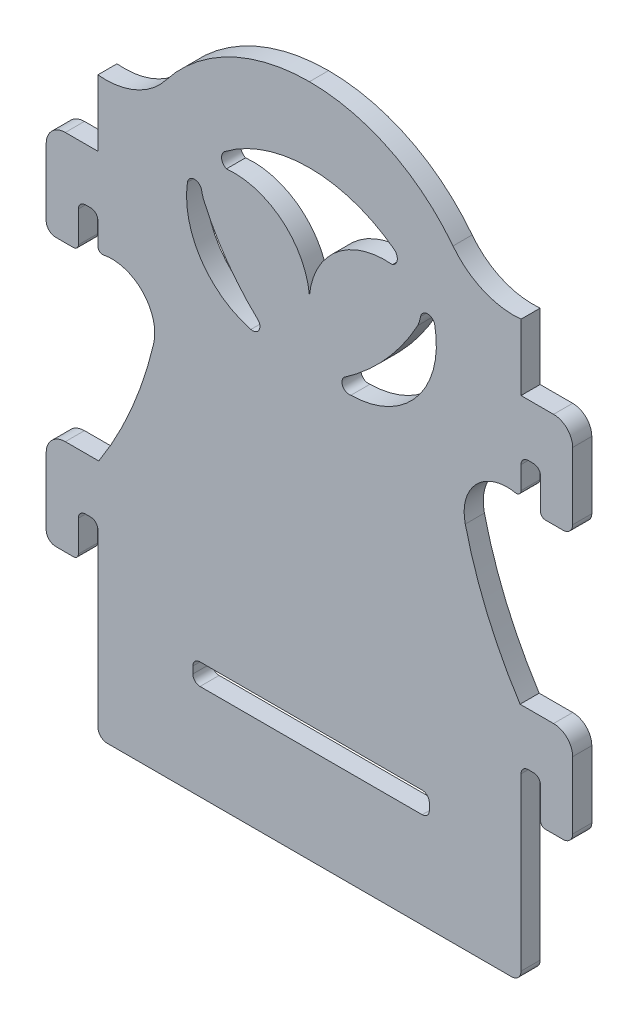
ISO-10303-21;
HEADER;
FILE_DESCRIPTION(('STEP AP214'),'2;1');
FILE_NAME('part.step','',(''),(''),'','','');
FILE_SCHEMA(('AUTOMOTIVE_DESIGN { 1 0 10303 214 1 1 1 1 }'));
ENDSEC;
DATA;
#1=APPLICATION_CONTEXT('core data for automotive mechanical design processes');
#2=APPLICATION_PROTOCOL_DEFINITION('international standard','automotive_design',2000,#1);
#3=PRODUCT_CONTEXT('',#1,'mechanical');
#4=PRODUCT('Part','Part','',(#3));
#5=PRODUCT_RELATED_PRODUCT_CATEGORY('part','',(#4));
#6=PRODUCT_DEFINITION_FORMATION('','',#4);
#7=PRODUCT_DEFINITION_CONTEXT('part definition',#1,'design');
#8=PRODUCT_DEFINITION('design','',#6,#7);
#9=PRODUCT_DEFINITION_SHAPE('','',#8);
#10=(LENGTH_UNIT() NAMED_UNIT(*) SI_UNIT(.MILLI.,.METRE.));
#11=(NAMED_UNIT(*) PLANE_ANGLE_UNIT() SI_UNIT($,.RADIAN.));
#12=(NAMED_UNIT(*) SI_UNIT($,.STERADIAN.) SOLID_ANGLE_UNIT());
#13=UNCERTAINTY_MEASURE_WITH_UNIT(LENGTH_MEASURE(1.E-05),#10,'distance_accuracy_value','');
#14=(GEOMETRIC_REPRESENTATION_CONTEXT(3) GLOBAL_UNCERTAINTY_ASSIGNED_CONTEXT((#13)) GLOBAL_UNIT_ASSIGNED_CONTEXT((#10,
#11,#12)) REPRESENTATION_CONTEXT('',''));
#15=CARTESIAN_POINT('',(0.,0.,0.));
#16=DIRECTION('',(0.,0.,1.));
#17=DIRECTION('',(1.,0.,0.));
#18=AXIS2_PLACEMENT_3D('',#15,#16,#17);
#19=CARTESIAN_POINT('',(-77.4165851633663,-168.178868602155,12.7));
#20=DIRECTION('',(-0.999999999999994,1.10987976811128E-07,0.));
#21=DIRECTION('',(-1.10987976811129E-07,-1.,0.));
#22=AXIS2_PLACEMENT_3D('',#19,#20,#21);
#23=PLANE('',#22);
#24=DIRECTION('',(0.,0.,1.));
#25=VECTOR('',#24,1.);
#26=CARTESIAN_POINT('',(-77.4165856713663,-172.755940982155,12.7));
#27=LINE('',#26,#25);
#28=CARTESIAN_POINT('',(-77.4165856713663,-172.755940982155,12.7));
#29=VERTEX_POINT('',#28);
#30=CARTESIAN_POINT('',(-77.4165856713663,-172.755940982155,25.4));
#31=VERTEX_POINT('',#30);
#32=EDGE_CURVE('E12',#29,#31,#27,.T.);
#33=ORIENTED_EDGE('',*,*,#32,.F.);
#34=DIRECTION('',(-1.10987976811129E-07,-1.,0.));
#35=VECTOR('',#34,1.);
#36=CARTESIAN_POINT('',(-77.4165851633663,-168.178868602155,12.7));
#37=LINE('',#36,#35);
#38=CARTESIAN_POINT('',(-77.4165851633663,-168.178868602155,12.7));
#39=VERTEX_POINT('',#38);
#40=EDGE_CURVE('E956',#39,#29,#37,.T.);
#41=ORIENTED_EDGE('',*,*,#40,.F.);
#42=DIRECTION('',(0.,0.,1.));
#43=VECTOR('',#42,1.);
#44=CARTESIAN_POINT('',(-77.4165851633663,-168.178868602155,12.7));
#45=LINE('',#44,#43);
#46=CARTESIAN_POINT('',(-77.4165851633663,-168.178868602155,25.4));
#47=VERTEX_POINT('',#46);
#48=EDGE_CURVE('E31',#39,#47,#45,.T.);
#49=ORIENTED_EDGE('',*,*,#48,.T.);
#50=DIRECTION('',(-1.10987976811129E-07,-1.,0.));
#51=VECTOR('',#50,1.);
#52=CARTESIAN_POINT('',(-77.4165851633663,-168.178868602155,25.4));
#53=LINE('',#52,#51);
#54=EDGE_CURVE('E594',#47,#31,#53,.T.);
#55=ORIENTED_EDGE('',*,*,#54,.T.);
#56=EDGE_LOOP('',(#33,#41,#49,#55));
#57=FACE_BOUND('',#56,.T.);
#58=ADVANCED_FACE('F20',(#57),#23,.F.);
#59=CARTESIAN_POINT('',(-72.6413855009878,-168.180511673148,12.7));
#60=DIRECTION('',(0.,0.,1.));
#61=DIRECTION('',(1.,0.,0.));
#62=AXIS2_PLACEMENT_3D('',#59,#60,#61);
#63=CYLINDRICAL_SURFACE('',#62,4.77519994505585);
#64=ORIENTED_EDGE('',*,*,#48,.F.);
#65=CARTESIAN_POINT('',(-72.6413855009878,-168.180511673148,12.7));
#66=DIRECTION('',(0.,0.,1.));
#67=DIRECTION('',(1.,0.,0.));
#68=AXIS2_PLACEMENT_3D('',#65,#66,#67);
#69=CIRCLE('',#68,4.77519994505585);
#70=CARTESIAN_POINT('',(-72.6413855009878,-163.405311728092,12.7));
#71=VERTEX_POINT('',#70);
#72=EDGE_CURVE('E960',#71,#39,#69,.T.);
#73=ORIENTED_EDGE('',*,*,#72,.F.);
#74=DIRECTION('',(0.,0.,1.));
#75=VECTOR('',#74,1.);
#76=CARTESIAN_POINT('',(-72.6413855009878,-163.405311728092,12.7));
#77=LINE('',#76,#75);
#78=CARTESIAN_POINT('',(-72.6413855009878,-163.405311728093,25.4));
#79=VERTEX_POINT('',#78);
#80=EDGE_CURVE('E2453',#71,#79,#77,.T.);
#81=ORIENTED_EDGE('',*,*,#80,.T.);
#82=CARTESIAN_POINT('',(-72.6413855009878,-168.180511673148,25.4));
#83=DIRECTION('',(0.,0.,1.));
#84=DIRECTION('',(1.,0.,0.));
#85=AXIS2_PLACEMENT_3D('',#82,#83,#84);
#86=CIRCLE('',#85,4.77519994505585);
#87=EDGE_CURVE('E2435',#79,#47,#86,.T.);
#88=ORIENTED_EDGE('',*,*,#87,.T.);
#89=EDGE_LOOP('',(#64,#73,#81,#88));
#90=FACE_BOUND('',#89,.T.);
#91=ADVANCED_FACE('F1593',(#90),#63,.F.);
#92=CARTESIAN_POINT('',(74.837803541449,-163.405311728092,12.7));
#93=DIRECTION('',(0.,1.,0.));
#94=DIRECTION('',(-1.,0.,0.));
#95=AXIS2_PLACEMENT_3D('',#92,#93,#94);
#96=PLANE('',#95);
#97=ORIENTED_EDGE('',*,*,#80,.F.);
#98=DIRECTION('',(-1.,0.,0.));
#99=VECTOR('',#98,1.);
#100=CARTESIAN_POINT('',(74.837803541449,-163.405311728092,12.7));
#101=LINE('',#100,#99);
#102=CARTESIAN_POINT('',(74.837803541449,-163.405311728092,12.7));
#103=VERTEX_POINT('',#102);
#104=EDGE_CURVE('E964',#103,#71,#101,.T.);
#105=ORIENTED_EDGE('',*,*,#104,.F.);
#106=DIRECTION('',(0.,0.,1.));
#107=VECTOR('',#106,1.);
#108=CARTESIAN_POINT('',(74.837803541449,-163.405311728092,12.7));
#109=LINE('',#108,#107);
#110=CARTESIAN_POINT('',(74.837803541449,-163.405311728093,25.4));
#111=VERTEX_POINT('',#110);
#112=EDGE_CURVE('E2451',#103,#111,#109,.T.);
#113=ORIENTED_EDGE('',*,*,#112,.T.);
#114=DIRECTION('',(1.,0.,0.));
#115=VECTOR('',#114,1.);
#116=CARTESIAN_POINT('',(-135.541034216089,-163.405311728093,25.4));
#117=LINE('',#116,#115);
#118=EDGE_CURVE('E2434',#111,#79,#117,.F.);
#119=ORIENTED_EDGE('',*,*,#118,.T.);
#120=EDGE_LOOP('',(#97,#105,#113,#119));
#121=FACE_BOUND('',#120,.T.);
#122=ADVANCED_FACE('F1598',(#121),#96,.F.);
#123=CARTESIAN_POINT('',(74.837803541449,-168.180511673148,12.7));
#124=DIRECTION('',(0.,0.,1.));
#125=DIRECTION('',(1.,0.,0.));
#126=AXIS2_PLACEMENT_3D('',#123,#124,#125);
#127=CYLINDRICAL_SURFACE('',#126,4.77519994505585);
#128=ORIENTED_EDGE('',*,*,#112,.F.);
#129=CARTESIAN_POINT('',(74.837803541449,-168.180511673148,12.7));
#130=DIRECTION('',(0.,0.,1.));
#131=DIRECTION('',(1.,0.,0.));
#132=AXIS2_PLACEMENT_3D('',#129,#130,#131);
#133=CIRCLE('',#132,4.77519994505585);
#134=CARTESIAN_POINT('',(79.6130032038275,-168.178868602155,12.7));
#135=VERTEX_POINT('',#134);
#136=EDGE_CURVE('E972',#135,#103,#133,.T.);
#137=ORIENTED_EDGE('',*,*,#136,.F.);
#138=DIRECTION('',(0.,0.,1.));
#139=VECTOR('',#138,1.);
#140=CARTESIAN_POINT('',(79.6130032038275,-168.178868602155,12.7));
#141=LINE('',#140,#139);
#142=CARTESIAN_POINT('',(79.6130032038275,-168.178868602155,25.4));
#143=VERTEX_POINT('',#142);
#144=EDGE_CURVE('E2450',#135,#143,#141,.T.);
#145=ORIENTED_EDGE('',*,*,#144,.T.);
#146=CARTESIAN_POINT('',(74.837803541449,-168.180511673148,25.4));
#147=DIRECTION('',(0.,0.,1.));
#148=DIRECTION('',(1.,0.,0.));
#149=AXIS2_PLACEMENT_3D('',#146,#147,#148);
#150=CIRCLE('',#149,4.77519994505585);
#151=EDGE_CURVE('E2430',#143,#111,#150,.T.);
#152=ORIENTED_EDGE('',*,*,#151,.T.);
#153=EDGE_LOOP('',(#128,#137,#145,#152));
#154=FACE_BOUND('',#153,.T.);
#155=ADVANCED_FACE('F1604',(#154),#127,.F.);
#156=CARTESIAN_POINT('',(79.6130037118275,-172.755940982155,12.7));
#157=DIRECTION('',(0.999999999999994,1.10987976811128E-07,0.));
#158=DIRECTION('',(-1.10987976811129E-07,1.,0.));
#159=AXIS2_PLACEMENT_3D('',#156,#157,#158);
#160=PLANE('',#159);
#161=ORIENTED_EDGE('',*,*,#144,.F.);
#162=DIRECTION('',(-1.10987976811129E-07,1.,0.));
#163=VECTOR('',#162,1.);
#164=CARTESIAN_POINT('',(79.6130037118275,-172.755940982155,12.7));
#165=LINE('',#164,#163);
#166=CARTESIAN_POINT('',(79.6130037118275,-172.755940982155,12.7));
#167=VERTEX_POINT('',#166);
#168=EDGE_CURVE('E975',#167,#135,#165,.T.);
#169=ORIENTED_EDGE('',*,*,#168,.F.);
#170=DIRECTION('',(0.,0.,1.));
#171=VECTOR('',#170,1.);
#172=CARTESIAN_POINT('',(79.6130037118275,-172.755940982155,12.7));
#173=LINE('',#172,#171);
#174=CARTESIAN_POINT('',(79.6130037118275,-172.755940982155,25.4));
#175=VERTEX_POINT('',#174);
#176=EDGE_CURVE('E306',#167,#175,#173,.T.);
#177=ORIENTED_EDGE('',*,*,#176,.T.);
#178=DIRECTION('',(-1.10987976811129E-07,1.,0.));
#179=VECTOR('',#178,1.);
#180=CARTESIAN_POINT('',(79.6130037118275,-172.755940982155,25.4));
#181=LINE('',#180,#179);
#182=EDGE_CURVE('E2426',#175,#143,#181,.T.);
#183=ORIENTED_EDGE('',*,*,#182,.T.);
#184=EDGE_LOOP('',(#161,#169,#177,#183));
#185=FACE_BOUND('',#184,.T.);
#186=ADVANCED_FACE('F1608',(#185),#160,.F.);
#187=CARTESIAN_POINT('',(74.8378036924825,-172.75594070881,12.7));
#188=DIRECTION('',(0.,0.,1.));
#189=DIRECTION('',(1.,0.,0.));
#190=AXIS2_PLACEMENT_3D('',#187,#188,#189);
#191=CYLINDRICAL_SURFACE('',#190,4.77520001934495);
#192=ORIENTED_EDGE('',*,*,#176,.F.);
#193=CARTESIAN_POINT('',(74.8378036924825,-172.75594070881,12.7));
#194=DIRECTION('',(0.,0.,1.));
#195=DIRECTION('',(1.,0.,0.));
#196=AXIS2_PLACEMENT_3D('',#193,#194,#195);
#197=CIRCLE('',#196,4.77520001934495);
#198=CARTESIAN_POINT('',(74.8378036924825,-177.531140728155,12.7));
#199=VERTEX_POINT('',#198);
#200=EDGE_CURVE('E979',#199,#167,#197,.T.);
#201=ORIENTED_EDGE('',*,*,#200,.F.);
#202=DIRECTION('',(0.,0.,1.));
#203=VECTOR('',#202,1.);
#204=CARTESIAN_POINT('',(74.8378036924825,-177.531140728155,12.7));
#205=LINE('',#204,#203);
#206=CARTESIAN_POINT('',(74.8378036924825,-177.531140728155,25.4));
#207=VERTEX_POINT('',#206);
#208=EDGE_CURVE('E39',#199,#207,#205,.T.);
#209=ORIENTED_EDGE('',*,*,#208,.T.);
#210=CARTESIAN_POINT('',(74.8378036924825,-172.75594070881,25.4));
#211=DIRECTION('',(0.,0.,1.));
#212=DIRECTION('',(1.,0.,0.));
#213=AXIS2_PLACEMENT_3D('',#210,#211,#212);
#214=CIRCLE('',#213,4.77520001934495);
#215=EDGE_CURVE('E2414',#207,#175,#214,.T.);
#216=ORIENTED_EDGE('',*,*,#215,.T.);
#217=EDGE_LOOP('',(#192,#201,#209,#216));
#218=FACE_BOUND('',#217,.T.);
#219=ADVANCED_FACE('F1589',(#218),#191,.F.);
#220=CARTESIAN_POINT('',(-72.6413856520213,-177.531140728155,12.7));
#221=DIRECTION('',(0.,-1.,0.));
#222=DIRECTION('',(1.,0.,0.));
#223=AXIS2_PLACEMENT_3D('',#220,#221,#222);
#224=PLANE('',#223);
#225=ORIENTED_EDGE('',*,*,#208,.F.);
#226=DIRECTION('',(1.,0.,0.));
#227=VECTOR('',#226,1.);
#228=CARTESIAN_POINT('',(-72.6413856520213,-177.531140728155,12.7));
#229=LINE('',#228,#227);
#230=CARTESIAN_POINT('',(-72.6413856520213,-177.531140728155,12.7));
#231=VERTEX_POINT('',#230);
#232=EDGE_CURVE('E945',#231,#199,#229,.T.);
#233=ORIENTED_EDGE('',*,*,#232,.F.);
#234=DIRECTION('',(0.,0.,1.));
#235=VECTOR('',#234,1.);
#236=CARTESIAN_POINT('',(-72.6413856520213,-177.531140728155,12.7));
#237=LINE('',#236,#235);
#238=CARTESIAN_POINT('',(-72.6413856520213,-177.531140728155,25.4));
#239=VERTEX_POINT('',#238);
#240=EDGE_CURVE('E24',#231,#239,#237,.T.);
#241=ORIENTED_EDGE('',*,*,#240,.T.);
#242=DIRECTION('',(1.,0.,0.));
#243=VECTOR('',#242,1.);
#244=CARTESIAN_POINT('',(-135.541034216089,-177.531140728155,25.4));
#245=LINE('',#244,#243);
#246=EDGE_CURVE('E567',#239,#207,#245,.T.);
#247=ORIENTED_EDGE('',*,*,#246,.T.);
#248=EDGE_LOOP('',(#225,#233,#241,#247));
#249=FACE_BOUND('',#248,.T.);
#250=ADVANCED_FACE('F1581',(#249),#224,.F.);
#251=CARTESIAN_POINT('',(-50.1768682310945,78.6985198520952,12.7));
#252=DIRECTION('',(0.,0.,-1.));
#253=DIRECTION('',(-1.,0.,0.));
#254=AXIS2_PLACEMENT_3D('',#251,#252,#253);
#255=CYLINDRICAL_SURFACE('',#254,50.416998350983);
#256=DIRECTION('',(0.,0.,1.));
#257=VECTOR('',#256,1.);
#258=CARTESIAN_POINT('',(0.,83.6133562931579,12.7));
#259=LINE('',#258,#257);
#260=CARTESIAN_POINT('',(0.,83.6133562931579,12.7));
#261=VERTEX_POINT('',#260);
#262=CARTESIAN_POINT('',(0.,83.6133562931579,25.4));
#263=VERTEX_POINT('',#262);
#264=EDGE_CURVE('E530',#261,#263,#259,.T.);
#265=ORIENTED_EDGE('',*,*,#264,.F.);
#266=CARTESIAN_POINT('',(-50.1768682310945,78.6985198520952,12.7));
#267=DIRECTION('',(0.,0.,-1.));
#268=DIRECTION('',(1.,0.,0.));
#269=AXIS2_PLACEMENT_3D('',#266,#267,#268);
#270=CIRCLE('',#269,50.416998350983);
#271=CARTESIAN_POINT('',(-55.0917046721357,128.875388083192,12.7));
#272=VERTEX_POINT('',#271);
#273=EDGE_CURVE('E934',#272,#261,#270,.T.);
#274=ORIENTED_EDGE('',*,*,#273,.F.);
#275=DIRECTION('',(0.,0.,1.));
#276=VECTOR('',#275,1.);
#277=CARTESIAN_POINT('',(-55.0917046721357,128.875388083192,12.7));
#278=LINE('',#277,#276);
#279=CARTESIAN_POINT('',(-55.0917046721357,128.875388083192,25.4));
#280=VERTEX_POINT('',#279);
#281=EDGE_CURVE('E1565',#272,#280,#278,.T.);
#282=ORIENTED_EDGE('',*,*,#281,.T.);
#283=CARTESIAN_POINT('',(-50.1768682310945,78.6985198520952,25.4));
#284=DIRECTION('',(0.,0.,-1.));
#285=DIRECTION('',(-1.,0.,0.));
#286=AXIS2_PLACEMENT_3D('',#283,#284,#285);
#287=CIRCLE('',#286,50.416998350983);
#288=EDGE_CURVE('E559',#280,#263,#287,.T.);
#289=ORIENTED_EDGE('',*,*,#288,.T.);
#290=EDGE_LOOP('',(#265,#274,#282,#289));
#291=FACE_BOUND('',#290,.T.);
#292=ADVANCED_FACE('F1579',(#291),#255,.T.);
#293=CARTESIAN_POINT('',(-52.8408577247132,133.912837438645,12.7));
#294=DIRECTION('',(0.,0.,1.));
#295=DIRECTION('',(1.,0.,0.));
#296=AXIS2_PLACEMENT_3D('',#293,#294,#295);
#297=CYLINDRICAL_SURFACE('',#296,5.51744578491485);
#298=ORIENTED_EDGE('',*,*,#281,.F.);
#299=CARTESIAN_POINT('',(-52.8408577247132,133.912837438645,12.7));
#300=DIRECTION('',(0.,0.,1.));
#301=DIRECTION('',(1.,0.,0.));
#302=AXIS2_PLACEMENT_3D('',#299,#300,#301);
#303=CIRCLE('',#302,5.51744578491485);
#304=CARTESIAN_POINT('',(-56.152311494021,138.3260541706,12.7));
#305=VERTEX_POINT('',#304);
#306=EDGE_CURVE('E937',#305,#272,#303,.T.);
#307=ORIENTED_EDGE('',*,*,#306,.F.);
#308=DIRECTION('',(0.,0.,1.));
#309=VECTOR('',#308,1.);
#310=CARTESIAN_POINT('',(-56.152311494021,138.3260541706,12.7));
#311=LINE('',#310,#309);
#312=CARTESIAN_POINT('',(-56.152311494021,138.3260541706,25.4));
#313=VERTEX_POINT('',#312);
#314=EDGE_CURVE('E1546',#305,#313,#311,.T.);
#315=ORIENTED_EDGE('',*,*,#314,.T.);
#316=CARTESIAN_POINT('',(-52.8408577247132,133.912837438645,25.4));
#317=DIRECTION('',(0.,0.,1.));
#318=DIRECTION('',(1.,0.,0.));
#319=AXIS2_PLACEMENT_3D('',#316,#317,#318);
#320=CIRCLE('',#319,5.51744578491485);
#321=EDGE_CURVE('E561',#313,#280,#320,.T.);
#322=ORIENTED_EDGE('',*,*,#321,.T.);
#323=EDGE_LOOP('',(#298,#307,#315,#322));
#324=FACE_BOUND('',#323,.T.);
#325=ADVANCED_FACE('F1572',(#324),#297,.F.);
#326=CARTESIAN_POINT('',(0.,63.4911514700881,12.7));
#327=DIRECTION('',(0.,0.,1.));
#328=DIRECTION('',(1.,0.,0.));
#329=AXIS2_PLACEMENT_3D('',#326,#327,#328);
#330=CYLINDRICAL_SURFACE('',#329,93.5593113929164);
#331=ORIENTED_EDGE('',*,*,#314,.F.);
#332=CARTESIAN_POINT('',(0.,63.4911514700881,12.7));
#333=DIRECTION('',(0.,0.,1.));
#334=DIRECTION('',(1.,0.,0.));
#335=AXIS2_PLACEMENT_3D('',#332,#333,#334);
#336=CIRCLE('',#335,93.5593113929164);
#337=CARTESIAN_POINT('',(56.1523114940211,138.3260541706,12.7));
#338=VERTEX_POINT('',#337);
#339=EDGE_CURVE('E941',#338,#305,#336,.T.);
#340=ORIENTED_EDGE('',*,*,#339,.F.);
#341=DIRECTION('',(0.,0.,1.));
#342=VECTOR('',#341,1.);
#343=CARTESIAN_POINT('',(56.1523114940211,138.3260541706,12.7));
#344=LINE('',#343,#342);
#345=CARTESIAN_POINT('',(56.1523114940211,138.3260541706,25.4));
#346=VERTEX_POINT('',#345);
#347=EDGE_CURVE('E544',#338,#346,#344,.T.);
#348=ORIENTED_EDGE('',*,*,#347,.T.);
#349=CARTESIAN_POINT('',(0.,63.4911514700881,25.4));
#350=DIRECTION('',(0.,0.,1.));
#351=DIRECTION('',(1.,0.,0.));
#352=AXIS2_PLACEMENT_3D('',#349,#350,#351);
#353=CIRCLE('',#352,93.5593113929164);
#354=EDGE_CURVE('E555',#346,#313,#353,.T.);
#355=ORIENTED_EDGE('',*,*,#354,.T.);
#356=EDGE_LOOP('',(#331,#340,#348,#355));
#357=FACE_BOUND('',#356,.T.);
#358=ADVANCED_FACE('F1575',(#357),#330,.F.);
#359=CARTESIAN_POINT('',(52.8408577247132,133.912837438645,12.7));
#360=DIRECTION('',(0.,0.,1.));
#361=DIRECTION('',(1.,0.,0.));
#362=AXIS2_PLACEMENT_3D('',#359,#360,#361);
#363=CYLINDRICAL_SURFACE('',#362,5.5174457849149);
#364=ORIENTED_EDGE('',*,*,#347,.F.);
#365=CARTESIAN_POINT('',(52.8408577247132,133.912837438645,12.7));
#366=DIRECTION('',(0.,0.,1.));
#367=DIRECTION('',(1.,0.,0.));
#368=AXIS2_PLACEMENT_3D('',#365,#366,#367);
#369=CIRCLE('',#368,5.5174457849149);
#370=CARTESIAN_POINT('',(55.0917046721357,128.875388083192,12.7));
#371=VERTEX_POINT('',#370);
#372=EDGE_CURVE('E542',#371,#338,#369,.T.);
#373=ORIENTED_EDGE('',*,*,#372,.F.);
#374=DIRECTION('',(0.,0.,1.));
#375=VECTOR('',#374,1.);
#376=CARTESIAN_POINT('',(55.0917046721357,128.875388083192,12.7));
#377=LINE('',#376,#375);
#378=CARTESIAN_POINT('',(55.0917046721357,128.875388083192,25.4));
#379=VERTEX_POINT('',#378);
#380=EDGE_CURVE('E536',#371,#379,#377,.T.);
#381=ORIENTED_EDGE('',*,*,#380,.T.);
#382=CARTESIAN_POINT('',(52.8408577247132,133.912837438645,25.4));
#383=DIRECTION('',(0.,0.,1.));
#384=DIRECTION('',(1.,0.,0.));
#385=AXIS2_PLACEMENT_3D('',#382,#383,#384);
#386=CIRCLE('',#385,5.5174457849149);
#387=EDGE_CURVE('E539',#379,#346,#386,.T.);
#388=ORIENTED_EDGE('',*,*,#387,.T.);
#389=EDGE_LOOP('',(#364,#373,#381,#388));
#390=FACE_BOUND('',#389,.T.);
#391=ADVANCED_FACE('F538',(#390),#363,.F.);
#392=CARTESIAN_POINT('',(-140.490803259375,96.3096813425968,12.7));
#393=DIRECTION('',(0.,1.,0.));
#394=DIRECTION('',(-1.,0.,0.));
#395=AXIS2_PLACEMENT_3D('',#392,#393,#394);
#396=PLANE('',#395);
#397=DIRECTION('',(0.,0.,1.));
#398=VECTOR('',#397,1.);
#399=CARTESIAN_POINT('',(-140.490803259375,96.3096813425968,12.7));
#400=LINE('',#399,#398);
#401=CARTESIAN_POINT('',(-140.490803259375,96.3096813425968,12.7));
#402=VERTEX_POINT('',#401);
#403=CARTESIAN_POINT('',(-140.490803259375,96.3096813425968,25.4));
#404=VERTEX_POINT('',#403);
#405=EDGE_CURVE('E545',#402,#404,#400,.T.);
#406=ORIENTED_EDGE('',*,*,#405,.F.);
#407=DIRECTION('',(-1.,0.,0.));
#408=VECTOR('',#407,1.);
#409=CARTESIAN_POINT('',(-140.490803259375,96.3096813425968,12.7));
#410=LINE('',#409,#408);
#411=CARTESIAN_POINT('',(-162.080803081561,96.3096813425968,12.7));
#412=VERTEX_POINT('',#411);
#413=EDGE_CURVE('E654',#402,#412,#410,.T.);
#414=ORIENTED_EDGE('',*,*,#413,.T.);
#415=DIRECTION('',(0.,0.,1.));
#416=VECTOR('',#415,1.);
#417=CARTESIAN_POINT('',(-162.080803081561,96.3096813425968,12.7));
#418=LINE('',#417,#416);
#419=CARTESIAN_POINT('',(-162.080803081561,96.3096813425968,25.4));
#420=VERTEX_POINT('',#419);
#421=EDGE_CURVE('E1298',#412,#420,#418,.T.);
#422=ORIENTED_EDGE('',*,*,#421,.T.);
#423=DIRECTION('',(1.,0.,0.));
#424=VECTOR('',#423,1.);
#425=CARTESIAN_POINT('',(-135.541034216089,96.3096813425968,25.4));
#426=LINE('',#425,#424);
#427=EDGE_CURVE('E1286',#404,#420,#426,.F.);
#428=ORIENTED_EDGE('',*,*,#427,.F.);
#429=EDGE_LOOP('',(#406,#414,#422,#428));
#430=FACE_BOUND('',#429,.T.);
#431=ADVANCED_FACE('F1296',(#430),#396,.T.);
#432=CARTESIAN_POINT('',(-162.080803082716,83.6096813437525,12.7));
#433=DIRECTION('',(0.,0.,1.));
#434=DIRECTION('',(1.,0.,0.));
#435=AXIS2_PLACEMENT_3D('',#432,#433,#434);
#436=CYLINDRICAL_SURFACE('',#435,12.6999999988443);
#437=ORIENTED_EDGE('',*,*,#421,.F.);
#438=CARTESIAN_POINT('',(-162.080803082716,83.6096813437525,12.7));
#439=DIRECTION('',(0.,0.,1.));
#440=DIRECTION('',(1.,0.,0.));
#441=AXIS2_PLACEMENT_3D('',#438,#439,#440);
#442=CIRCLE('',#441,12.6999999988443);
#443=CARTESIAN_POINT('',(-174.780803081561,83.6096805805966,12.7));
#444=VERTEX_POINT('',#443);
#445=EDGE_CURVE('E658',#412,#444,#442,.T.);
#446=ORIENTED_EDGE('',*,*,#445,.T.);
#447=DIRECTION('',(0.,0.,1.));
#448=VECTOR('',#447,1.);
#449=CARTESIAN_POINT('',(-174.780803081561,83.6096805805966,12.7));
#450=LINE('',#449,#448);
#451=CARTESIAN_POINT('',(-174.780803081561,83.6096805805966,25.4));
#452=VERTEX_POINT('',#451);
#453=EDGE_CURVE('E1301',#444,#452,#450,.T.);
#454=ORIENTED_EDGE('',*,*,#453,.T.);
#455=CARTESIAN_POINT('',(-162.080803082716,83.6096813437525,25.4));
#456=DIRECTION('',(0.,0.,1.));
#457=DIRECTION('',(1.,0.,0.));
#458=AXIS2_PLACEMENT_3D('',#455,#456,#457);
#459=CIRCLE('',#458,12.6999999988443);
#460=EDGE_CURVE('E1282',#420,#452,#459,.T.);
#461=ORIENTED_EDGE('',*,*,#460,.F.);
#462=EDGE_LOOP('',(#437,#446,#454,#461));
#463=FACE_BOUND('',#462,.T.);
#464=ADVANCED_FACE('F1651',(#463),#436,.T.);
#465=CARTESIAN_POINT('',(-174.780803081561,83.6096805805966,12.7));
#466=DIRECTION('',(-1.,0.,0.));
#467=DIRECTION('',(0.,-1.,0.));
#468=AXIS2_PLACEMENT_3D('',#465,#466,#467);
#469=PLANE('',#468);
#470=ORIENTED_EDGE('',*,*,#453,.F.);
#471=DIRECTION('',(0.,-1.,0.));
#472=VECTOR('',#471,1.);
#473=CARTESIAN_POINT('',(-174.780803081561,83.6096805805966,12.7));
#474=LINE('',#473,#472);
#475=CARTESIAN_POINT('',(-174.780803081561,39.1596808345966,12.7));
#476=VERTEX_POINT('',#475);
#477=EDGE_CURVE('E662',#444,#476,#474,.T.);
#478=ORIENTED_EDGE('',*,*,#477,.T.);
#479=DIRECTION('',(0.,0.,1.));
#480=VECTOR('',#479,1.);
#481=CARTESIAN_POINT('',(-174.780803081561,39.1596808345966,12.7));
#482=LINE('',#481,#480);
#483=CARTESIAN_POINT('',(-174.780803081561,39.1596808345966,25.4));
#484=VERTEX_POINT('',#483);
#485=EDGE_CURVE('E1304',#476,#484,#482,.T.);
#486=ORIENTED_EDGE('',*,*,#485,.T.);
#487=DIRECTION('',(0.,1.,0.));
#488=VECTOR('',#487,1.);
#489=CARTESIAN_POINT('',(-174.780803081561,190.794361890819,25.4));
#490=LINE('',#489,#488);
#491=EDGE_CURVE('E1285',#452,#484,#490,.F.);
#492=ORIENTED_EDGE('',*,*,#491,.F.);
#493=EDGE_LOOP('',(#470,#478,#486,#492));
#494=FACE_BOUND('',#493,.T.);
#495=ADVANCED_FACE('F1657',(#494),#469,.T.);
#496=CARTESIAN_POINT('',(-168.431463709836,39.159020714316,12.7));
#497=DIRECTION('',(0.,0.,1.));
#498=DIRECTION('',(1.,0.,0.));
#499=AXIS2_PLACEMENT_3D('',#496,#497,#498);
#500=CYLINDRICAL_SURFACE('',#499,6.34933940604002);
#501=ORIENTED_EDGE('',*,*,#485,.F.);
#502=CARTESIAN_POINT('',(-168.431463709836,39.159020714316,12.7));
#503=DIRECTION('',(0.,0.,1.));
#504=DIRECTION('',(1.,0.,0.));
#505=AXIS2_PLACEMENT_3D('',#502,#503,#504);
#506=CIRCLE('',#505,6.34933940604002);
#507=CARTESIAN_POINT('',(-168.432123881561,32.8096813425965,12.7));
#508=VERTEX_POINT('',#507);
#509=EDGE_CURVE('E670',#476,#508,#506,.T.);
#510=ORIENTED_EDGE('',*,*,#509,.T.);
#511=DIRECTION('',(0.,0.,1.));
#512=VECTOR('',#511,1.);
#513=CARTESIAN_POINT('',(-168.432123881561,32.8096813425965,12.7));
#514=LINE('',#513,#512);
#515=CARTESIAN_POINT('',(-168.432123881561,32.8096813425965,25.4));
#516=VERTEX_POINT('',#515);
#517=EDGE_CURVE('E1320',#508,#516,#514,.T.);
#518=ORIENTED_EDGE('',*,*,#517,.T.);
#519=CARTESIAN_POINT('',(-168.431463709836,39.159020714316,25.4));
#520=DIRECTION('',(0.,0.,1.));
#521=DIRECTION('',(1.,0.,0.));
#522=AXIS2_PLACEMENT_3D('',#519,#520,#521);
#523=CIRCLE('',#522,6.34933940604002);
#524=EDGE_CURVE('E1277',#484,#516,#523,.T.);
#525=ORIENTED_EDGE('',*,*,#524,.F.);
#526=EDGE_LOOP('',(#501,#510,#518,#525));
#527=FACE_BOUND('',#526,.T.);
#528=ADVANCED_FACE('F1663',(#527),#500,.T.);
#529=CARTESIAN_POINT('',(-168.432123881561,32.8096813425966,12.7));
#530=DIRECTION('',(2.15052178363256E-08,-1.,0.));
#531=DIRECTION('',(1.,2.15052178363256E-08,0.));
#532=AXIS2_PLACEMENT_3D('',#529,#530,#531);
#533=PLANE('',#532);
#534=ORIENTED_EDGE('',*,*,#517,.F.);
#535=DIRECTION('',(1.,2.15052178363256E-08,0.));
#536=VECTOR('',#535,1.);
#537=CARTESIAN_POINT('',(-168.432123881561,32.8096813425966,12.7));
#538=LINE('',#537,#536);
#539=CARTESIAN_POINT('',(-156.621033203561,32.8096815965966,12.7));
#540=VERTEX_POINT('',#539);
#541=EDGE_CURVE('E673',#508,#540,#538,.T.);
#542=ORIENTED_EDGE('',*,*,#541,.T.);
#543=DIRECTION('',(0.,0.,1.));
#544=VECTOR('',#543,1.);
#545=CARTESIAN_POINT('',(-156.621033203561,32.8096815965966,12.7));
#546=LINE('',#545,#544);
#547=CARTESIAN_POINT('',(-156.621033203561,32.8096815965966,25.4));
#548=VERTEX_POINT('',#547);
#549=EDGE_CURVE('E1323',#540,#548,#546,.T.);
#550=ORIENTED_EDGE('',*,*,#549,.T.);
#551=DIRECTION('',(1.,2.15052178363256E-08,0.));
#552=VECTOR('',#551,1.);
#553=CARTESIAN_POINT('',(-168.432123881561,32.8096813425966,25.4));
#554=LINE('',#553,#552);
#555=EDGE_CURVE('E1273',#516,#548,#554,.T.);
#556=ORIENTED_EDGE('',*,*,#555,.F.);
#557=EDGE_LOOP('',(#534,#542,#550,#556));
#558=FACE_BOUND('',#557,.T.);
#559=ADVANCED_FACE('F1671',(#558),#533,.T.);
#560=CARTESIAN_POINT('',(-156.61980288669,35.9846811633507,12.7));
#561=DIRECTION('',(0.,0.,1.));
#562=DIRECTION('',(1.,0.,0.));
#563=AXIS2_PLACEMENT_3D('',#560,#561,#562);
#564=CYLINDRICAL_SURFACE('',#563,3.17499980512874);
#565=ORIENTED_EDGE('',*,*,#549,.F.);
#566=CARTESIAN_POINT('',(-156.61980288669,35.9846811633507,12.7));
#567=DIRECTION('',(0.,0.,1.));
#568=DIRECTION('',(1.,0.,0.));
#569=AXIS2_PLACEMENT_3D('',#566,#567,#568);
#570=CIRCLE('',#569,3.17499980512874);
#571=CARTESIAN_POINT('',(-153.444803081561,35.9846813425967,12.7));
#572=VERTEX_POINT('',#571);
#573=EDGE_CURVE('E677',#540,#572,#570,.T.);
#574=ORIENTED_EDGE('',*,*,#573,.T.);
#575=DIRECTION('',(0.,0.,1.));
#576=VECTOR('',#575,1.);
#577=CARTESIAN_POINT('',(-153.444803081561,35.9846813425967,12.7));
#578=LINE('',#577,#576);
#579=CARTESIAN_POINT('',(-153.444803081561,35.9846813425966,25.4));
#580=VERTEX_POINT('',#579);
#581=EDGE_CURVE('E1326',#572,#580,#578,.T.);
#582=ORIENTED_EDGE('',*,*,#581,.T.);
#583=CARTESIAN_POINT('',(-156.61980288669,35.9846811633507,25.4));
#584=DIRECTION('',(0.,0.,1.));
#585=DIRECTION('',(1.,0.,0.));
#586=AXIS2_PLACEMENT_3D('',#583,#584,#585);
#587=CIRCLE('',#586,3.17499980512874);
#588=EDGE_CURVE('E1269',#548,#580,#587,.T.);
#589=ORIENTED_EDGE('',*,*,#588,.F.);
#590=EDGE_LOOP('',(#565,#574,#582,#589));
#591=FACE_BOUND('',#590,.T.);
#592=ADVANCED_FACE('F1679',(#591),#564,.T.);
#593=CARTESIAN_POINT('',(-153.444803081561,35.9846813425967,12.7));
#594=DIRECTION('',(1.,0.,0.));
#595=DIRECTION('',(0.,1.,0.));
#596=AXIS2_PLACEMENT_3D('',#593,#594,#595);
#597=PLANE('',#596);
#598=ORIENTED_EDGE('',*,*,#581,.F.);
#599=DIRECTION('',(0.,1.,0.));
#600=VECTOR('',#599,1.);
#601=CARTESIAN_POINT('',(-153.444803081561,35.9846813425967,12.7));
#602=LINE('',#601,#600);
#603=CARTESIAN_POINT('',(-153.444803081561,56.6094813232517,12.7));
#604=VERTEX_POINT('',#603);
#605=EDGE_CURVE('E681',#572,#604,#602,.T.);
#606=ORIENTED_EDGE('',*,*,#605,.T.);
#607=DIRECTION('',(0.,0.,1.));
#608=VECTOR('',#607,1.);
#609=CARTESIAN_POINT('',(-153.444803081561,56.6094813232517,12.7));
#610=LINE('',#609,#608);
#611=CARTESIAN_POINT('',(-153.444803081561,56.6094813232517,25.4));
#612=VERTEX_POINT('',#611);
#613=EDGE_CURVE('E1334',#604,#612,#610,.T.);
#614=ORIENTED_EDGE('',*,*,#613,.T.);
#615=DIRECTION('',(0.,1.,0.));
#616=VECTOR('',#615,1.);
#617=CARTESIAN_POINT('',(-153.444803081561,190.794361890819,25.4));
#618=LINE('',#617,#616);
#619=EDGE_CURVE('E1266',#580,#612,#618,.T.);
#620=ORIENTED_EDGE('',*,*,#619,.F.);
#621=EDGE_LOOP('',(#598,#606,#614,#620));
#622=FACE_BOUND('',#621,.T.);
#623=ADVANCED_FACE('F1687',(#622),#597,.T.);
#624=CARTESIAN_POINT('',(-148.669603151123,56.6094813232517,12.7));
#625=DIRECTION('',(0.,0.,-1.));
#626=DIRECTION('',(-1.,0.,0.));
#627=AXIS2_PLACEMENT_3D('',#624,#625,#626);
#628=CYLINDRICAL_SURFACE('',#627,4.7751999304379);
#629=ORIENTED_EDGE('',*,*,#613,.F.);
#630=CARTESIAN_POINT('',(-148.669603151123,56.6094813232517,12.7));
#631=DIRECTION('',(0.,0.,-1.));
#632=DIRECTION('',(1.,0.,0.));
#633=AXIS2_PLACEMENT_3D('',#630,#631,#632);
#634=CIRCLE('',#633,4.7751999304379);
#635=CARTESIAN_POINT('',(-148.669603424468,61.3846812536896,12.7));
#636=VERTEX_POINT('',#635);
#637=EDGE_CURVE('E689',#604,#636,#634,.T.);
#638=ORIENTED_EDGE('',*,*,#637,.T.);
#639=DIRECTION('',(0.,0.,1.));
#640=VECTOR('',#639,1.);
#641=CARTESIAN_POINT('',(-148.669603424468,61.3846812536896,12.7));
#642=LINE('',#641,#640);
#643=CARTESIAN_POINT('',(-148.669603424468,61.3846812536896,25.4));
#644=VERTEX_POINT('',#643);
#645=EDGE_CURVE('E1336',#636,#644,#642,.T.);
#646=ORIENTED_EDGE('',*,*,#645,.T.);
#647=CARTESIAN_POINT('',(-148.669603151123,56.6094813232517,25.4));
#648=DIRECTION('',(0.,0.,-1.));
#649=DIRECTION('',(-1.,0.,0.));
#650=AXIS2_PLACEMENT_3D('',#647,#648,#649);
#651=CIRCLE('',#650,4.7751999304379);
#652=EDGE_CURVE('E1258',#612,#644,#651,.T.);
#653=ORIENTED_EDGE('',*,*,#652,.F.);
#654=EDGE_LOOP('',(#629,#638,#646,#653));
#655=FACE_BOUND('',#654,.T.);
#656=ADVANCED_FACE('F1695',(#655),#628,.F.);
#657=CARTESIAN_POINT('',(-148.669603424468,61.3846812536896,12.7));
#658=DIRECTION('',(0.,-1.,0.));
#659=DIRECTION('',(1.,0.,0.));
#660=AXIS2_PLACEMENT_3D('',#657,#658,#659);
#661=PLANE('',#660);
#662=ORIENTED_EDGE('',*,*,#645,.F.);
#663=DIRECTION('',(1.,0.,0.));
#664=VECTOR('',#663,1.);
#665=CARTESIAN_POINT('',(-148.669603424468,61.3846812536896,12.7));
#666=LINE('',#665,#664);
#667=CARTESIAN_POINT('',(-145.266003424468,61.3846812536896,12.7));
#668=VERTEX_POINT('',#667);
#669=EDGE_CURVE('E692',#636,#668,#666,.T.);
#670=ORIENTED_EDGE('',*,*,#669,.T.);
#671=DIRECTION('',(0.,0.,1.));
#672=VECTOR('',#671,1.);
#673=CARTESIAN_POINT('',(-145.266003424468,61.3846812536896,12.7));
#674=LINE('',#673,#672);
#675=CARTESIAN_POINT('',(-145.266003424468,61.3846812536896,25.4));
#676=VERTEX_POINT('',#675);
#677=EDGE_CURVE('E1339',#668,#676,#674,.T.);
#678=ORIENTED_EDGE('',*,*,#677,.T.);
#679=DIRECTION('',(1.,0.,0.));
#680=VECTOR('',#679,1.);
#681=CARTESIAN_POINT('',(-135.541034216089,61.3846812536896,25.4));
#682=LINE('',#681,#680);
#683=EDGE_CURVE('E1254',#644,#676,#682,.T.);
#684=ORIENTED_EDGE('',*,*,#683,.F.);
#685=EDGE_LOOP('',(#662,#670,#678,#684));
#686=FACE_BOUND('',#685,.T.);
#687=ADVANCED_FACE('F1703',(#686),#661,.T.);
#688=CARTESIAN_POINT('',(-145.266003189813,56.6094813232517,12.7));
#689=DIRECTION('',(0.,0.,-1.));
#690=DIRECTION('',(-1.,0.,0.));
#691=AXIS2_PLACEMENT_3D('',#688,#689,#690);
#692=CYLINDRICAL_SURFACE('',#691,4.77519993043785);
#693=ORIENTED_EDGE('',*,*,#677,.F.);
#694=CARTESIAN_POINT('',(-145.266003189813,56.6094813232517,12.7));
#695=DIRECTION('',(0.,0.,-1.));
#696=DIRECTION('',(1.,0.,0.));
#697=AXIS2_PLACEMENT_3D('',#694,#695,#696);
#698=CIRCLE('',#697,4.77519993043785);
#699=CARTESIAN_POINT('',(-140.490803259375,56.6094813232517,12.7));
#700=VERTEX_POINT('',#699);
#701=EDGE_CURVE('E696',#668,#700,#698,.T.);
#702=ORIENTED_EDGE('',*,*,#701,.T.);
#703=DIRECTION('',(0.,0.,1.));
#704=VECTOR('',#703,1.);
#705=CARTESIAN_POINT('',(-140.490803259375,56.6094813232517,12.7));
#706=LINE('',#705,#704);
#707=CARTESIAN_POINT('',(-140.490803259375,56.6094813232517,25.4));
#708=VERTEX_POINT('',#707);
#709=EDGE_CURVE('E1342',#700,#708,#706,.T.);
#710=ORIENTED_EDGE('',*,*,#709,.T.);
#711=CARTESIAN_POINT('',(-145.266003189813,56.6094813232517,25.4));
#712=DIRECTION('',(0.,0.,-1.));
#713=DIRECTION('',(-1.,0.,0.));
#714=AXIS2_PLACEMENT_3D('',#711,#712,#713);
#715=CIRCLE('',#714,4.77519993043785);
#716=EDGE_CURVE('E1250',#676,#708,#715,.T.);
#717=ORIENTED_EDGE('',*,*,#716,.F.);
#718=EDGE_LOOP('',(#693,#702,#710,#717));
#719=FACE_BOUND('',#718,.T.);
#720=ADVANCED_FACE('F1711',(#719),#692,.F.);
#721=CARTESIAN_POINT('',(-140.490803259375,56.6094813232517,12.7));
#722=DIRECTION('',(-1.,0.,0.));
#723=DIRECTION('',(0.,-1.,0.));
#724=AXIS2_PLACEMENT_3D('',#721,#722,#723);
#725=PLANE('',#724);
#726=ORIENTED_EDGE('',*,*,#709,.F.);
#727=DIRECTION('',(0.,-1.,0.));
#728=VECTOR('',#727,1.);
#729=CARTESIAN_POINT('',(-140.490803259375,56.6094813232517,12.7));
#730=LINE('',#729,#728);
#731=CARTESIAN_POINT('',(-140.490803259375,41.6668645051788,12.7));
#732=VERTEX_POINT('',#731);
#733=EDGE_CURVE('E700',#700,#732,#730,.T.);
#734=ORIENTED_EDGE('',*,*,#733,.T.);
#735=DIRECTION('',(0.,0.,1.));
#736=VECTOR('',#735,1.);
#737=CARTESIAN_POINT('',(-140.490803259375,41.6668645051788,12.7));
#738=LINE('',#737,#736);
#739=CARTESIAN_POINT('',(-140.490803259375,41.6668645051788,25.4));
#740=VERTEX_POINT('',#739);
#741=EDGE_CURVE('E1350',#732,#740,#738,.T.);
#742=ORIENTED_EDGE('',*,*,#741,.T.);
#743=DIRECTION('',(0.,1.,0.));
#744=VECTOR('',#743,1.);
#745=CARTESIAN_POINT('',(-140.490803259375,190.794361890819,25.4));
#746=LINE('',#745,#744);
#747=EDGE_CURVE('E1248',#708,#740,#746,.F.);
#748=ORIENTED_EDGE('',*,*,#747,.F.);
#749=EDGE_LOOP('',(#726,#734,#742,#748));
#750=FACE_BOUND('',#749,.T.);
#751=ADVANCED_FACE('F1719',(#750),#725,.T.);
#752=CARTESIAN_POINT('',(-137.315803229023,41.6668645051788,12.7));
#753=DIRECTION('',(0.,0.,1.));
#754=DIRECTION('',(1.,0.,0.));
#755=AXIS2_PLACEMENT_3D('',#752,#753,#754);
#756=CYLINDRICAL_SURFACE('',#755,3.17500003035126);
#757=ORIENTED_EDGE('',*,*,#741,.F.);
#758=CARTESIAN_POINT('',(-137.315803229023,41.6668645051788,12.7));
#759=DIRECTION('',(0.,0.,1.));
#760=DIRECTION('',(1.,0.,0.));
#761=AXIS2_PLACEMENT_3D('',#758,#759,#760);
#762=CIRCLE('',#761,3.17500003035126);
#763=CARTESIAN_POINT('',(-136.712554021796,38.5496998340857,12.7));
#764=VERTEX_POINT('',#763);
#765=EDGE_CURVE('E708',#732,#764,#762,.T.);
#766=ORIENTED_EDGE('',*,*,#765,.T.);
#767=DIRECTION('',(0.,0.,1.));
#768=VECTOR('',#767,1.);
#769=CARTESIAN_POINT('',(-136.712554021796,38.5496998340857,12.7));
#770=LINE('',#769,#768);
#771=CARTESIAN_POINT('',(-136.712554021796,38.5496998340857,25.4));
#772=VERTEX_POINT('',#771);
#773=EDGE_CURVE('E1352',#764,#772,#770,.T.);
#774=ORIENTED_EDGE('',*,*,#773,.T.);
#775=CARTESIAN_POINT('',(-137.315803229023,41.6668645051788,25.4));
#776=DIRECTION('',(0.,0.,1.));
#777=DIRECTION('',(1.,0.,0.));
#778=AXIS2_PLACEMENT_3D('',#775,#776,#777);
#779=CIRCLE('',#778,3.17500003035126);
#780=EDGE_CURVE('E1244',#740,#772,#779,.T.);
#781=ORIENTED_EDGE('',*,*,#780,.F.);
#782=EDGE_LOOP('',(#757,#766,#774,#781));
#783=FACE_BOUND('',#782,.T.);
#784=ADVANCED_FACE('F1727',(#783),#756,.T.);
#785=CARTESIAN_POINT('',(-131.283317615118,10.4952284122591,12.7));
#786=DIRECTION('',(0.,0.,-1.));
#787=DIRECTION('',(-1.,0.,0.));
#788=AXIS2_PLACEMENT_3D('',#785,#786,#787);
#789=CYLINDRICAL_SURFACE('',#788,28.5749886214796);
#790=ORIENTED_EDGE('',*,*,#773,.F.);
#791=CARTESIAN_POINT('',(-131.283317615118,10.4952284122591,12.7));
#792=DIRECTION('',(0.,0.,-1.));
#793=DIRECTION('',(1.,0.,0.));
#794=AXIS2_PLACEMENT_3D('',#791,#792,#793);
#795=CIRCLE('',#794,28.5749886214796);
#796=CARTESIAN_POINT('',(-103.478512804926,3.90563023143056,12.7));
#797=VERTEX_POINT('',#796);
#798=EDGE_CURVE('E711',#764,#797,#795,.T.);
#799=ORIENTED_EDGE('',*,*,#798,.T.);
#800=DIRECTION('',(0.,0.,1.));
#801=VECTOR('',#800,1.);
#802=CARTESIAN_POINT('',(-103.478512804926,3.90563023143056,12.7));
#803=LINE('',#802,#801);
#804=CARTESIAN_POINT('',(-103.478512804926,3.90563023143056,25.4));
#805=VERTEX_POINT('',#804);
#806=EDGE_CURVE('E1355',#797,#805,#803,.T.);
#807=ORIENTED_EDGE('',*,*,#806,.T.);
#808=CARTESIAN_POINT('',(-131.283317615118,10.4952284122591,25.4));
#809=DIRECTION('',(0.,0.,-1.));
#810=DIRECTION('',(-1.,0.,0.));
#811=AXIS2_PLACEMENT_3D('',#808,#809,#810);
#812=CIRCLE('',#811,28.5749886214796);
#813=EDGE_CURVE('E1236',#772,#805,#812,.T.);
#814=ORIENTED_EDGE('',*,*,#813,.F.);
#815=EDGE_LOOP('',(#790,#799,#807,#814));
#816=FACE_BOUND('',#815,.T.);
#817=ADVANCED_FACE('F1735',(#816),#789,.F.);
#818=CARTESIAN_POINT('',(-370.404733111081,67.1659111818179,12.7));
#819=DIRECTION('',(0.,0.,-1.));
#820=DIRECTION('',(-1.,0.,0.));
#821=AXIS2_PLACEMENT_3D('',#818,#819,#820);
#822=CYLINDRICAL_SURFACE('',#821,274.320014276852);
#823=ORIENTED_EDGE('',*,*,#806,.F.);
#824=CARTESIAN_POINT('',(-370.404733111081,67.1659111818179,12.7));
#825=DIRECTION('',(0.,0.,-1.));
#826=DIRECTION('',(1.,0.,0.));
#827=AXIS2_PLACEMENT_3D('',#824,#825,#826);
#828=CIRCLE('',#827,274.320014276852);
#829=CARTESIAN_POINT('',(-139.855822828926,-81.4903036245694,12.7));
#830=VERTEX_POINT('',#829);
#831=EDGE_CURVE('E715',#797,#830,#828,.T.);
#832=ORIENTED_EDGE('',*,*,#831,.T.);
#833=DIRECTION('',(0.,0.,1.));
#834=VECTOR('',#833,1.);
#835=CARTESIAN_POINT('',(-139.855822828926,-81.4903036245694,12.7));
#836=LINE('',#835,#834);
#837=CARTESIAN_POINT('',(-139.855822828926,-81.4903036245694,25.4));
#838=VERTEX_POINT('',#837);
#839=EDGE_CURVE('E1358',#830,#838,#836,.T.);
#840=ORIENTED_EDGE('',*,*,#839,.T.);
#841=CARTESIAN_POINT('',(-370.404733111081,67.1659111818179,25.4));
#842=DIRECTION('',(0.,0.,-1.));
#843=DIRECTION('',(-1.,0.,0.));
#844=AXIS2_PLACEMENT_3D('',#841,#842,#843);
#845=CIRCLE('',#844,274.320014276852);
#846=EDGE_CURVE('E1232',#805,#838,#845,.T.);
#847=ORIENTED_EDGE('',*,*,#846,.F.);
#848=EDGE_LOOP('',(#823,#832,#840,#847));
#849=FACE_BOUND('',#848,.T.);
#850=ADVANCED_FACE('F1743',(#849),#822,.F.);
#851=CARTESIAN_POINT('',(-139.855822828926,-81.4903036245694,12.7));
#852=DIRECTION('',(-3.88571771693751E-07,0.999999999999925,0.));
#853=DIRECTION('',(-0.999999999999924,-3.8857177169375E-07,0.));
#854=AXIS2_PLACEMENT_3D('',#851,#852,#853);
#855=PLANE('',#854);
#856=ORIENTED_EDGE('',*,*,#839,.F.);
#857=DIRECTION('',(-0.999999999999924,-3.8857177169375E-07,0.));
#858=VECTOR('',#857,1.);
#859=CARTESIAN_POINT('',(-139.855822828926,-81.4903036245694,12.7));
#860=LINE('',#859,#858);
#861=CARTESIAN_POINT('',(-162.080803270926,-81.4903122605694,12.7));
#862=VERTEX_POINT('',#861);
#863=EDGE_CURVE('E719',#830,#862,#860,.T.);
#864=ORIENTED_EDGE('',*,*,#863,.T.);
#865=DIRECTION('',(0.,0.,1.));
#866=VECTOR('',#865,1.);
#867=CARTESIAN_POINT('',(-162.080803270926,-81.4903122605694,12.7));
#868=LINE('',#867,#866);
#869=CARTESIAN_POINT('',(-162.080803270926,-81.4903122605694,25.4));
#870=VERTEX_POINT('',#869);
#871=EDGE_CURVE('E1366',#862,#870,#868,.T.);
#872=ORIENTED_EDGE('',*,*,#871,.T.);
#873=DIRECTION('',(-0.999999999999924,-3.8857177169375E-07,0.));
#874=VECTOR('',#873,1.);
#875=CARTESIAN_POINT('',(-139.855822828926,-81.4903036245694,25.4));
#876=LINE('',#875,#874);
#877=EDGE_CURVE('E1228',#838,#870,#876,.T.);
#878=ORIENTED_EDGE('',*,*,#877,.F.);
#879=EDGE_LOOP('',(#856,#864,#872,#878));
#880=FACE_BOUND('',#879,.T.);
#881=ADVANCED_FACE('F1751',(#880),#855,.T.);
#882=CARTESIAN_POINT('',(-162.080803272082,-94.1903122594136,12.7));
#883=DIRECTION('',(0.,0.,1.));
#884=DIRECTION('',(1.,0.,0.));
#885=AXIS2_PLACEMENT_3D('',#882,#883,#884);
#886=CYLINDRICAL_SURFACE('',#885,12.6999999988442);
#887=ORIENTED_EDGE('',*,*,#871,.F.);
#888=CARTESIAN_POINT('',(-162.080803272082,-94.1903122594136,12.7));
#889=DIRECTION('',(0.,0.,1.));
#890=DIRECTION('',(1.,0.,0.));
#891=AXIS2_PLACEMENT_3D('',#888,#889,#890);
#892=CIRCLE('',#891,12.6999999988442);
#893=CARTESIAN_POINT('',(-174.780803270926,-94.1903130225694,12.7));
#894=VERTEX_POINT('',#893);
#895=EDGE_CURVE('E727',#862,#894,#892,.T.);
#896=ORIENTED_EDGE('',*,*,#895,.T.);
#897=DIRECTION('',(0.,0.,1.));
#898=VECTOR('',#897,1.);
#899=CARTESIAN_POINT('',(-174.780803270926,-94.1903130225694,12.7));
#900=LINE('',#899,#898);
#901=CARTESIAN_POINT('',(-174.780803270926,-94.1903130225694,25.4));
#902=VERTEX_POINT('',#901);
#903=EDGE_CURVE('E1368',#894,#902,#900,.T.);
#904=ORIENTED_EDGE('',*,*,#903,.T.);
#905=CARTESIAN_POINT('',(-162.080803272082,-94.1903122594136,25.4));
#906=DIRECTION('',(0.,0.,1.));
#907=DIRECTION('',(1.,0.,0.));
#908=AXIS2_PLACEMENT_3D('',#905,#906,#907);
#909=CIRCLE('',#908,12.6999999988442);
#910=EDGE_CURVE('E1225',#870,#902,#909,.T.);
#911=ORIENTED_EDGE('',*,*,#910,.F.);
#912=EDGE_LOOP('',(#887,#896,#904,#911));
#913=FACE_BOUND('',#912,.T.);
#914=ADVANCED_FACE('F1759',(#913),#886,.T.);
#915=CARTESIAN_POINT('',(-174.780803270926,-94.1903130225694,12.7));
#916=DIRECTION('',(-1.,0.,0.));
#917=DIRECTION('',(0.,-1.,0.));
#918=AXIS2_PLACEMENT_3D('',#915,#916,#917);
#919=PLANE('',#918);
#920=ORIENTED_EDGE('',*,*,#903,.F.);
#921=DIRECTION('',(0.,-1.,0.));
#922=VECTOR('',#921,1.);
#923=CARTESIAN_POINT('',(-174.780803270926,-94.1903130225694,12.7));
#924=LINE('',#923,#922);
#925=CARTESIAN_POINT('',(-174.780803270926,-138.640312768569,12.7));
#926=VERTEX_POINT('',#925);
#927=EDGE_CURVE('E730',#894,#926,#924,.T.);
#928=ORIENTED_EDGE('',*,*,#927,.T.);
#929=DIRECTION('',(0.,0.,1.));
#930=VECTOR('',#929,1.);
#931=CARTESIAN_POINT('',(-174.780803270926,-138.640312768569,12.7));
#932=LINE('',#931,#930);
#933=CARTESIAN_POINT('',(-174.780803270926,-138.640312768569,25.4));
#934=VERTEX_POINT('',#933);
#935=EDGE_CURVE('E1371',#926,#934,#932,.T.);
#936=ORIENTED_EDGE('',*,*,#935,.T.);
#937=DIRECTION('',(0.,1.,0.));
#938=VECTOR('',#937,1.);
#939=CARTESIAN_POINT('',(-174.780803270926,190.794361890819,25.4));
#940=LINE('',#939,#938);
#941=EDGE_CURVE('E1219',#902,#934,#940,.F.);
#942=ORIENTED_EDGE('',*,*,#941,.F.);
#943=EDGE_LOOP('',(#920,#928,#936,#942));
#944=FACE_BOUND('',#943,.T.);
#945=ADVANCED_FACE('F1767',(#944),#919,.T.);
#946=CARTESIAN_POINT('',(-168.431476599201,-138.64098558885,12.7));
#947=DIRECTION('',(0.,0.,1.));
#948=DIRECTION('',(1.,0.,0.));
#949=AXIS2_PLACEMENT_3D('',#946,#947,#948);
#950=CYLINDRICAL_SURFACE('',#949,6.34932670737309);
#951=ORIENTED_EDGE('',*,*,#935,.F.);
#952=CARTESIAN_POINT('',(-168.431476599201,-138.64098558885,12.7));
#953=DIRECTION('',(0.,0.,1.));
#954=DIRECTION('',(1.,0.,0.));
#955=AXIS2_PLACEMENT_3D('',#952,#953,#954);
#956=CIRCLE('',#955,6.34932670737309);
#957=CARTESIAN_POINT('',(-168.432149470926,-144.990312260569,12.7));
#958=VERTEX_POINT('',#957);
#959=EDGE_CURVE('E734',#926,#958,#956,.T.);
#960=ORIENTED_EDGE('',*,*,#959,.T.);
#961=DIRECTION('',(0.,0.,1.));
#962=VECTOR('',#961,1.);
#963=CARTESIAN_POINT('',(-168.432149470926,-144.990312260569,12.7));
#964=LINE('',#963,#962);
#965=CARTESIAN_POINT('',(-168.432149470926,-144.990312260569,25.4));
#966=VERTEX_POINT('',#965);
#967=EDGE_CURVE('E1374',#958,#966,#964,.T.);
#968=ORIENTED_EDGE('',*,*,#967,.T.);
#969=CARTESIAN_POINT('',(-168.431476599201,-138.64098558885,25.4));
#970=DIRECTION('',(0.,0.,1.));
#971=DIRECTION('',(1.,0.,0.));
#972=AXIS2_PLACEMENT_3D('',#969,#970,#971);
#973=CIRCLE('',#972,6.34932670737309);
#974=EDGE_CURVE('E1215',#934,#966,#973,.T.);
#975=ORIENTED_EDGE('',*,*,#974,.F.);
#976=EDGE_LOOP('',(#951,#960,#968,#975));
#977=FACE_BOUND('',#976,.T.);
#978=ADVANCED_FACE('F1775',(#977),#950,.T.);
#979=CARTESIAN_POINT('',(-168.432149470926,-144.990312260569,12.7));
#980=DIRECTION('',(0.,-1.,0.));
#981=DIRECTION('',(1.,0.,0.));
#982=AXIS2_PLACEMENT_3D('',#979,#980,#981);
#983=PLANE('',#982);
#984=ORIENTED_EDGE('',*,*,#967,.F.);
#985=DIRECTION('',(1.,0.,0.));
#986=VECTOR('',#985,1.);
#987=CARTESIAN_POINT('',(-168.432149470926,-144.990312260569,12.7));
#988=LINE('',#987,#986);
#989=CARTESIAN_POINT('',(-156.621047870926,-144.990312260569,12.7));
#990=VERTEX_POINT('',#989);
#991=EDGE_CURVE('E738',#958,#990,#988,.T.);
#992=ORIENTED_EDGE('',*,*,#991,.T.);
#993=DIRECTION('',(0.,0.,1.));
#994=VECTOR('',#993,1.);
#995=CARTESIAN_POINT('',(-156.621047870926,-144.990312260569,12.7));
#996=LINE('',#995,#994);
#997=CARTESIAN_POINT('',(-156.621047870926,-144.990312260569,25.4));
#998=VERTEX_POINT('',#997);
#999=EDGE_CURVE('E1382',#990,#998,#996,.T.);
#1000=ORIENTED_EDGE('',*,*,#999,.T.);
#1001=DIRECTION('',(1.,0.,0.));
#1002=VECTOR('',#1001,1.);
#1003=CARTESIAN_POINT('',(-135.541034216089,-144.990312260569,25.4));
#1004=LINE('',#1003,#1002);
#1005=EDGE_CURVE('E1211',#966,#998,#1004,.T.);
#1006=ORIENTED_EDGE('',*,*,#1005,.F.);
#1007=EDGE_LOOP('',(#984,#992,#1000,#1006));
#1008=FACE_BOUND('',#1007,.T.);
#1009=ADVANCED_FACE('F1783',(#1008),#983,.T.);
#1010=CARTESIAN_POINT('',(-156.619810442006,-141.815305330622,12.7));
#1011=DIRECTION('',(0.,0.,1.));
#1012=DIRECTION('',(1.,0.,0.));
#1013=AXIS2_PLACEMENT_3D('',#1010,#1011,#1012);
#1014=CYLINDRICAL_SURFACE('',#1013,3.17500717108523);
#1015=ORIENTED_EDGE('',*,*,#999,.F.);
#1016=CARTESIAN_POINT('',(-156.619810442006,-141.815305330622,12.7));
#1017=DIRECTION('',(0.,0.,1.));
#1018=DIRECTION('',(1.,0.,0.));
#1019=AXIS2_PLACEMENT_3D('',#1016,#1017,#1018);
#1020=CIRCLE('',#1019,3.17500717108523);
#1021=CARTESIAN_POINT('',(-153.44480327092,-141.815305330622,12.7));
#1022=VERTEX_POINT('',#1021);
#1023=EDGE_CURVE('E746',#990,#1022,#1020,.T.);
#1024=ORIENTED_EDGE('',*,*,#1023,.T.);
#1025=DIRECTION('',(0.,0.,1.));
#1026=VECTOR('',#1025,1.);
#1027=CARTESIAN_POINT('',(-153.44480327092,-141.815305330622,12.7));
#1028=LINE('',#1027,#1026);
#1029=CARTESIAN_POINT('',(-153.44480327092,-141.815305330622,25.4));
#1030=VERTEX_POINT('',#1029);
#1031=EDGE_CURVE('E1384',#1022,#1030,#1028,.T.);
#1032=ORIENTED_EDGE('',*,*,#1031,.T.);
#1033=CARTESIAN_POINT('',(-156.619810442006,-141.815305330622,25.4));
#1034=DIRECTION('',(0.,0.,1.));
#1035=DIRECTION('',(1.,0.,0.));
#1036=AXIS2_PLACEMENT_3D('',#1033,#1034,#1035);
#1037=CIRCLE('',#1036,3.17500717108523);
#1038=EDGE_CURVE('E1208',#998,#1030,#1037,.T.);
#1039=ORIENTED_EDGE('',*,*,#1038,.F.);
#1040=EDGE_LOOP('',(#1015,#1024,#1032,#1039));
#1041=FACE_BOUND('',#1040,.T.);
#1042=ADVANCED_FACE('F1791',(#1041),#1014,.T.);
#1043=CARTESIAN_POINT('',(-153.44480327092,-141.815305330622,12.7));
#1044=DIRECTION('',(1.,0.,0.));
#1045=DIRECTION('',(0.,1.,0.));
#1046=AXIS2_PLACEMENT_3D('',#1043,#1044,#1045);
#1047=PLANE('',#1046);
#1048=ORIENTED_EDGE('',*,*,#1031,.F.);
#1049=DIRECTION('',(0.,1.,0.));
#1050=VECTOR('',#1049,1.);
#1051=CARTESIAN_POINT('',(-153.44480327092,-141.815305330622,12.7));
#1052=LINE('',#1051,#1050);
#1053=CARTESIAN_POINT('',(-153.44480327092,-121.190512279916,12.7));
#1054=VERTEX_POINT('',#1053);
#1055=EDGE_CURVE('E749',#1022,#1054,#1052,.T.);
#1056=ORIENTED_EDGE('',*,*,#1055,.T.);
#1057=DIRECTION('',(0.,0.,1.));
#1058=VECTOR('',#1057,1.);
#1059=CARTESIAN_POINT('',(-153.44480327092,-121.190512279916,12.7));
#1060=LINE('',#1059,#1058);
#1061=CARTESIAN_POINT('',(-153.44480327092,-121.190512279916,25.4));
#1062=VERTEX_POINT('',#1061);
#1063=EDGE_CURVE('E1387',#1054,#1062,#1060,.T.);
#1064=ORIENTED_EDGE('',*,*,#1063,.T.);
#1065=DIRECTION('',(0.,1.,0.));
#1066=VECTOR('',#1065,1.);
#1067=CARTESIAN_POINT('',(-153.44480327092,190.794361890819,25.4));
#1068=LINE('',#1067,#1066);
#1069=EDGE_CURVE('E1200',#1030,#1062,#1068,.T.);
#1070=ORIENTED_EDGE('',*,*,#1069,.F.);
#1071=EDGE_LOOP('',(#1048,#1056,#1064,#1070));
#1072=FACE_BOUND('',#1071,.T.);
#1073=ADVANCED_FACE('F1799',(#1072),#1047,.T.);
#1074=CARTESIAN_POINT('',(-148.6696032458,-121.190512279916,12.7));
#1075=DIRECTION('',(0.,0.,-1.));
#1076=DIRECTION('',(-1.,0.,0.));
#1077=AXIS2_PLACEMENT_3D('',#1074,#1075,#1076);
#1078=CYLINDRICAL_SURFACE('',#1077,4.77520002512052);
#1079=ORIENTED_EDGE('',*,*,#1063,.F.);
#1080=CARTESIAN_POINT('',(-148.6696032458,-121.190512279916,12.7));
#1081=DIRECTION('',(0.,0.,-1.));
#1082=DIRECTION('',(1.,0.,0.));
#1083=AXIS2_PLACEMENT_3D('',#1080,#1081,#1082);
#1084=CIRCLE('',#1083,4.77520002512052);
#1085=CARTESIAN_POINT('',(-148.66960351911,-116.415312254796,12.7));
#1086=VERTEX_POINT('',#1085);
#1087=EDGE_CURVE('E753',#1054,#1086,#1084,.T.);
#1088=ORIENTED_EDGE('',*,*,#1087,.T.);
#1089=DIRECTION('',(0.,0.,1.));
#1090=VECTOR('',#1089,1.);
#1091=CARTESIAN_POINT('',(-148.66960351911,-116.415312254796,12.7));
#1092=LINE('',#1091,#1090);
#1093=CARTESIAN_POINT('',(-148.66960351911,-116.415312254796,25.4));
#1094=VERTEX_POINT('',#1093);
#1095=EDGE_CURVE('E1390',#1086,#1094,#1092,.T.);
#1096=ORIENTED_EDGE('',*,*,#1095,.T.);
#1097=CARTESIAN_POINT('',(-148.6696032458,-121.190512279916,25.4));
#1098=DIRECTION('',(0.,0.,-1.));
#1099=DIRECTION('',(-1.,0.,0.));
#1100=AXIS2_PLACEMENT_3D('',#1097,#1098,#1099);
#1101=CIRCLE('',#1100,4.77520002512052);
#1102=EDGE_CURVE('E1196',#1062,#1094,#1101,.T.);
#1103=ORIENTED_EDGE('',*,*,#1102,.F.);
#1104=EDGE_LOOP('',(#1079,#1088,#1096,#1103));
#1105=FACE_BOUND('',#1104,.T.);
#1106=ADVANCED_FACE('F1807',(#1105),#1078,.F.);
#1107=CARTESIAN_POINT('',(-148.66960351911,-116.415312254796,12.7));
#1108=DIRECTION('',(0.,-1.,0.));
#1109=DIRECTION('',(1.,0.,0.));
#1110=AXIS2_PLACEMENT_3D('',#1107,#1108,#1109);
#1111=PLANE('',#1110);
#1112=ORIENTED_EDGE('',*,*,#1095,.F.);
#1113=DIRECTION('',(1.,0.,0.));
#1114=VECTOR('',#1113,1.);
#1115=CARTESIAN_POINT('',(-148.66960351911,-116.415312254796,12.7));
#1116=LINE('',#1115,#1114);
#1117=CARTESIAN_POINT('',(-145.26600351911,-116.415312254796,12.7));
#1118=VERTEX_POINT('',#1117);
#1119=EDGE_CURVE('E757',#1086,#1118,#1116,.T.);
#1120=ORIENTED_EDGE('',*,*,#1119,.T.);
#1121=DIRECTION('',(0.,0.,1.));
#1122=VECTOR('',#1121,1.);
#1123=CARTESIAN_POINT('',(-145.26600351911,-116.415312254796,12.7));
#1124=LINE('',#1123,#1122);
#1125=CARTESIAN_POINT('',(-145.26600351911,-116.415312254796,25.4));
#1126=VERTEX_POINT('',#1125);
#1127=EDGE_CURVE('E1398',#1118,#1126,#1124,.T.);
#1128=ORIENTED_EDGE('',*,*,#1127,.T.);
#1129=DIRECTION('',(1.,0.,0.));
#1130=VECTOR('',#1129,1.);
#1131=CARTESIAN_POINT('',(-135.541034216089,-116.415312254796,25.4));
#1132=LINE('',#1131,#1130);
#1133=EDGE_CURVE('E1192',#1094,#1126,#1132,.T.);
#1134=ORIENTED_EDGE('',*,*,#1133,.F.);
#1135=EDGE_LOOP('',(#1112,#1120,#1128,#1134));
#1136=FACE_BOUND('',#1135,.T.);
#1137=ADVANCED_FACE('F1815',(#1136),#1111,.T.);
#1138=CARTESIAN_POINT('',(-145.266003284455,-121.190512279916,12.7));
#1139=DIRECTION('',(0.,0.,-1.));
#1140=DIRECTION('',(-1.,0.,0.));
#1141=AXIS2_PLACEMENT_3D('',#1138,#1139,#1140);
#1142=CYLINDRICAL_SURFACE('',#1141,4.77520002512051);
#1143=ORIENTED_EDGE('',*,*,#1127,.F.);
#1144=CARTESIAN_POINT('',(-145.266003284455,-121.190512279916,12.7));
#1145=DIRECTION('',(0.,0.,-1.));
#1146=DIRECTION('',(1.,0.,0.));
#1147=AXIS2_PLACEMENT_3D('',#1144,#1145,#1146);
#1148=CIRCLE('',#1147,4.77520002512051);
#1149=CARTESIAN_POINT('',(-140.490803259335,-121.190512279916,12.7));
#1150=VERTEX_POINT('',#1149);
#1151=EDGE_CURVE('E765',#1118,#1150,#1148,.T.);
#1152=ORIENTED_EDGE('',*,*,#1151,.T.);
#1153=DIRECTION('',(0.,0.,1.));
#1154=VECTOR('',#1153,1.);
#1155=CARTESIAN_POINT('',(-140.490803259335,-121.190512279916,12.7));
#1156=LINE('',#1155,#1154);
#1157=CARTESIAN_POINT('',(-140.490803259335,-121.190512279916,25.4));
#1158=VERTEX_POINT('',#1157);
#1159=EDGE_CURVE('E1400',#1150,#1158,#1156,.T.);
#1160=ORIENTED_EDGE('',*,*,#1159,.T.);
#1161=CARTESIAN_POINT('',(-145.266003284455,-121.190512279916,25.4));
#1162=DIRECTION('',(0.,0.,-1.));
#1163=DIRECTION('',(-1.,0.,0.));
#1164=AXIS2_PLACEMENT_3D('',#1161,#1162,#1163);
#1165=CIRCLE('',#1164,4.77520002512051);
#1166=EDGE_CURVE('E1189',#1126,#1158,#1165,.T.);
#1167=ORIENTED_EDGE('',*,*,#1166,.F.);
#1168=EDGE_LOOP('',(#1143,#1152,#1160,#1167));
#1169=FACE_BOUND('',#1168,.T.);
#1170=ADVANCED_FACE('F1823',(#1169),#1142,.F.);
#1171=CARTESIAN_POINT('',(-140.490803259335,-121.190512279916,12.7));
#1172=DIRECTION('',(-1.,0.,0.));
#1173=DIRECTION('',(0.,-1.,0.));
#1174=AXIS2_PLACEMENT_3D('',#1171,#1172,#1173);
#1175=PLANE('',#1174);
#1176=ORIENTED_EDGE('',*,*,#1159,.F.);
#1177=DIRECTION('',(0.,-1.,0.));
#1178=VECTOR('',#1177,1.);
#1179=CARTESIAN_POINT('',(-140.490803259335,-121.190512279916,12.7));
#1180=LINE('',#1179,#1178);
#1181=CARTESIAN_POINT('',(-140.490803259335,-234.681141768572,12.7));
#1182=VERTEX_POINT('',#1181);
#1183=EDGE_CURVE('E768',#1150,#1182,#1180,.T.);
#1184=ORIENTED_EDGE('',*,*,#1183,.T.);
#1185=DIRECTION('',(0.,0.,1.));
#1186=VECTOR('',#1185,1.);
#1187=CARTESIAN_POINT('',(-140.490803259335,-234.681141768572,12.7));
#1188=LINE('',#1187,#1186);
#1189=CARTESIAN_POINT('',(-140.490803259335,-234.681141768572,25.4));
#1190=VERTEX_POINT('',#1189);
#1191=EDGE_CURVE('E1403',#1182,#1190,#1188,.T.);
#1192=ORIENTED_EDGE('',*,*,#1191,.T.);
#1193=DIRECTION('',(0.,1.,0.));
#1194=VECTOR('',#1193,1.);
#1195=CARTESIAN_POINT('',(-140.490803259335,190.794361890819,25.4));
#1196=LINE('',#1195,#1194);
#1197=EDGE_CURVE('E1183',#1158,#1190,#1196,.F.);
#1198=ORIENTED_EDGE('',*,*,#1197,.F.);
#1199=EDGE_LOOP('',(#1176,#1184,#1192,#1198));
#1200=FACE_BOUND('',#1199,.T.);
#1201=ADVANCED_FACE('F1831',(#1200),#1175,.T.);
#1202=CARTESIAN_POINT('',(-134.14080323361,-234.681141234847,12.7));
#1203=DIRECTION('',(0.,0.,1.));
#1204=DIRECTION('',(1.,0.,0.));
#1205=AXIS2_PLACEMENT_3D('',#1202,#1203,#1204);
#1206=CYLINDRICAL_SURFACE('',#1205,6.35000002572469);
#1207=ORIENTED_EDGE('',*,*,#1191,.F.);
#1208=CARTESIAN_POINT('',(-134.14080323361,-234.681141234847,12.7));
#1209=DIRECTION('',(0.,0.,1.));
#1210=DIRECTION('',(1.,0.,0.));
#1211=AXIS2_PLACEMENT_3D('',#1208,#1209,#1210);
#1212=CIRCLE('',#1211,6.35000002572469);
#1213=CARTESIAN_POINT('',(-134.140802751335,-241.031141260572,12.7));
#1214=VERTEX_POINT('',#1213);
#1215=EDGE_CURVE('E772',#1182,#1214,#1212,.T.);
#1216=ORIENTED_EDGE('',*,*,#1215,.T.);
#1217=DIRECTION('',(0.,0.,1.));
#1218=VECTOR('',#1217,1.);
#1219=CARTESIAN_POINT('',(-134.140802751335,-241.031141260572,12.7));
#1220=LINE('',#1219,#1218);
#1221=CARTESIAN_POINT('',(-134.140802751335,-241.031141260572,25.4));
#1222=VERTEX_POINT('',#1221);
#1223=EDGE_CURVE('E1406',#1214,#1222,#1220,.T.);
#1224=ORIENTED_EDGE('',*,*,#1223,.T.);
#1225=CARTESIAN_POINT('',(-134.14080323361,-234.681141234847,25.4));
#1226=DIRECTION('',(0.,0.,1.));
#1227=DIRECTION('',(1.,0.,0.));
#1228=AXIS2_PLACEMENT_3D('',#1225,#1226,#1227);
#1229=CIRCLE('',#1228,6.35000002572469);
#1230=EDGE_CURVE('E1179',#1190,#1222,#1229,.T.);
#1231=ORIENTED_EDGE('',*,*,#1230,.F.);
#1232=EDGE_LOOP('',(#1207,#1216,#1224,#1231));
#1233=FACE_BOUND('',#1232,.T.);
#1234=ADVANCED_FACE('F1839',(#1233),#1206,.T.);
#1235=CARTESIAN_POINT('',(-134.140802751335,-241.031141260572,12.7));
#1236=DIRECTION('',(0.,-1.,0.));
#1237=DIRECTION('',(1.,0.,0.));
#1238=AXIS2_PLACEMENT_3D('',#1235,#1236,#1237);
#1239=PLANE('',#1238);
#1240=ORIENTED_EDGE('',*,*,#1223,.F.);
#1241=DIRECTION('',(1.,0.,0.));
#1242=VECTOR('',#1241,1.);
#1243=CARTESIAN_POINT('',(-134.140802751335,-241.031141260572,12.7));
#1244=LINE('',#1243,#1242);
#1245=CARTESIAN_POINT('',(134.140802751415,-241.031141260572,12.7));
#1246=VERTEX_POINT('',#1245);
#1247=EDGE_CURVE('E776',#1214,#1246,#1244,.T.);
#1248=ORIENTED_EDGE('',*,*,#1247,.T.);
#1249=DIRECTION('',(0.,0.,1.));
#1250=VECTOR('',#1249,1.);
#1251=CARTESIAN_POINT('',(134.140802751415,-241.031141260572,12.7));
#1252=LINE('',#1251,#1250);
#1253=CARTESIAN_POINT('',(134.140802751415,-241.031141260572,25.4));
#1254=VERTEX_POINT('',#1253);
#1255=EDGE_CURVE('E1414',#1246,#1254,#1252,.T.);
#1256=ORIENTED_EDGE('',*,*,#1255,.T.);
#1257=DIRECTION('',(1.,0.,0.));
#1258=VECTOR('',#1257,1.);
#1259=CARTESIAN_POINT('',(-135.541034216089,-241.031141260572,25.4));
#1260=LINE('',#1259,#1258);
#1261=EDGE_CURVE('E1175',#1222,#1254,#1260,.T.);
#1262=ORIENTED_EDGE('',*,*,#1261,.F.);
#1263=EDGE_LOOP('',(#1240,#1248,#1256,#1262));
#1264=FACE_BOUND('',#1263,.T.);
#1265=ADVANCED_FACE('F1847',(#1264),#1239,.T.);
#1266=CARTESIAN_POINT('',(134.14080323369,-234.681141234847,12.7));
#1267=DIRECTION('',(0.,0.,1.));
#1268=DIRECTION('',(1.,0.,0.));
#1269=AXIS2_PLACEMENT_3D('',#1266,#1267,#1268);
#1270=CYLINDRICAL_SURFACE('',#1269,6.35000002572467);
#1271=ORIENTED_EDGE('',*,*,#1255,.F.);
#1272=CARTESIAN_POINT('',(134.14080323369,-234.681141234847,12.7));
#1273=DIRECTION('',(0.,0.,1.));
#1274=DIRECTION('',(1.,0.,0.));
#1275=AXIS2_PLACEMENT_3D('',#1272,#1273,#1274);
#1276=CIRCLE('',#1275,6.35000002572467);
#1277=CARTESIAN_POINT('',(140.490803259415,-234.681141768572,12.7));
#1278=VERTEX_POINT('',#1277);
#1279=EDGE_CURVE('E784',#1246,#1278,#1276,.T.);
#1280=ORIENTED_EDGE('',*,*,#1279,.T.);
#1281=DIRECTION('',(0.,0.,1.));
#1282=VECTOR('',#1281,1.);
#1283=CARTESIAN_POINT('',(140.490803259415,-234.681141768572,12.7));
#1284=LINE('',#1283,#1282);
#1285=CARTESIAN_POINT('',(140.490803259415,-234.681141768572,25.4));
#1286=VERTEX_POINT('',#1285);
#1287=EDGE_CURVE('E1416',#1278,#1286,#1284,.T.);
#1288=ORIENTED_EDGE('',*,*,#1287,.T.);
#1289=CARTESIAN_POINT('',(134.14080323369,-234.681141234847,25.4));
#1290=DIRECTION('',(0.,0.,1.));
#1291=DIRECTION('',(1.,0.,0.));
#1292=AXIS2_PLACEMENT_3D('',#1289,#1290,#1291);
#1293=CIRCLE('',#1292,6.35000002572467);
#1294=EDGE_CURVE('E1172',#1254,#1286,#1293,.T.);
#1295=ORIENTED_EDGE('',*,*,#1294,.F.);
#1296=EDGE_LOOP('',(#1271,#1280,#1288,#1295));
#1297=FACE_BOUND('',#1296,.T.);
#1298=ADVANCED_FACE('F1855',(#1297),#1270,.T.);
#1299=CARTESIAN_POINT('',(140.490803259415,-234.681141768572,12.7));
#1300=DIRECTION('',(1.,0.,0.));
#1301=DIRECTION('',(0.,1.,0.));
#1302=AXIS2_PLACEMENT_3D('',#1299,#1300,#1301);
#1303=PLANE('',#1302);
#1304=ORIENTED_EDGE('',*,*,#1287,.F.);
#1305=DIRECTION('',(0.,1.,0.));
#1306=VECTOR('',#1305,1.);
#1307=CARTESIAN_POINT('',(140.490803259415,-234.681141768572,12.7));
#1308=LINE('',#1307,#1306);
#1309=CARTESIAN_POINT('',(140.490803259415,-121.190512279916,12.7));
#1310=VERTEX_POINT('',#1309);
#1311=EDGE_CURVE('E787',#1278,#1310,#1308,.T.);
#1312=ORIENTED_EDGE('',*,*,#1311,.T.);
#1313=DIRECTION('',(0.,0.,1.));
#1314=VECTOR('',#1313,1.);
#1315=CARTESIAN_POINT('',(140.490803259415,-121.190512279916,12.7));
#1316=LINE('',#1315,#1314);
#1317=CARTESIAN_POINT('',(140.490803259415,-121.190512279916,25.4));
#1318=VERTEX_POINT('',#1317);
#1319=EDGE_CURVE('E1419',#1310,#1318,#1316,.T.);
#1320=ORIENTED_EDGE('',*,*,#1319,.T.);
#1321=DIRECTION('',(0.,1.,0.));
#1322=VECTOR('',#1321,1.);
#1323=CARTESIAN_POINT('',(140.490803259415,190.794361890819,25.4));
#1324=LINE('',#1323,#1322);
#1325=EDGE_CURVE('E1164',#1286,#1318,#1324,.T.);
#1326=ORIENTED_EDGE('',*,*,#1325,.F.);
#1327=EDGE_LOOP('',(#1304,#1312,#1320,#1326));
#1328=FACE_BOUND('',#1327,.T.);
#1329=ADVANCED_FACE('F1863',(#1328),#1303,.T.);
#1330=CARTESIAN_POINT('',(145.266003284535,-121.190512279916,12.7));
#1331=DIRECTION('',(0.,0.,-1.));
#1332=DIRECTION('',(-1.,0.,0.));
#1333=AXIS2_PLACEMENT_3D('',#1330,#1331,#1332);
#1334=CYLINDRICAL_SURFACE('',#1333,4.7752000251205);
#1335=ORIENTED_EDGE('',*,*,#1319,.F.);
#1336=CARTESIAN_POINT('',(145.266003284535,-121.190512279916,12.7));
#1337=DIRECTION('',(0.,0.,-1.));
#1338=DIRECTION('',(1.,0.,0.));
#1339=AXIS2_PLACEMENT_3D('',#1336,#1337,#1338);
#1340=CIRCLE('',#1339,4.7752000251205);
#1341=CARTESIAN_POINT('',(145.26600351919,-116.415312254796,12.7));
#1342=VERTEX_POINT('',#1341);
#1343=EDGE_CURVE('E791',#1310,#1342,#1340,.T.);
#1344=ORIENTED_EDGE('',*,*,#1343,.T.);
#1345=DIRECTION('',(0.,0.,1.));
#1346=VECTOR('',#1345,1.);
#1347=CARTESIAN_POINT('',(145.26600351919,-116.415312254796,12.7));
#1348=LINE('',#1347,#1346);
#1349=CARTESIAN_POINT('',(145.26600351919,-116.415312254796,25.4));
#1350=VERTEX_POINT('',#1349);
#1351=EDGE_CURVE('E1422',#1342,#1350,#1348,.T.);
#1352=ORIENTED_EDGE('',*,*,#1351,.T.);
#1353=CARTESIAN_POINT('',(145.266003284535,-121.190512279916,25.4));
#1354=DIRECTION('',(0.,0.,-1.));
#1355=DIRECTION('',(-1.,0.,0.));
#1356=AXIS2_PLACEMENT_3D('',#1353,#1354,#1355);
#1357=CIRCLE('',#1356,4.7752000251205);
#1358=EDGE_CURVE('E1160',#1318,#1350,#1357,.T.);
#1359=ORIENTED_EDGE('',*,*,#1358,.F.);
#1360=EDGE_LOOP('',(#1335,#1344,#1352,#1359));
#1361=FACE_BOUND('',#1360,.T.);
#1362=ADVANCED_FACE('F1871',(#1361),#1334,.F.);
#1363=CARTESIAN_POINT('',(145.26600351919,-116.415312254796,12.7));
#1364=DIRECTION('',(0.,-1.,0.));
#1365=DIRECTION('',(1.,0.,0.));
#1366=AXIS2_PLACEMENT_3D('',#1363,#1364,#1365);
#1367=PLANE('',#1366);
#1368=ORIENTED_EDGE('',*,*,#1351,.F.);
#1369=DIRECTION('',(1.,0.,0.));
#1370=VECTOR('',#1369,1.);
#1371=CARTESIAN_POINT('',(145.26600351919,-116.415312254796,12.7));
#1372=LINE('',#1371,#1370);
#1373=CARTESIAN_POINT('',(148.66960351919,-116.415312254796,12.7));
#1374=VERTEX_POINT('',#1373);
#1375=EDGE_CURVE('E795',#1342,#1374,#1372,.T.);
#1376=ORIENTED_EDGE('',*,*,#1375,.T.);
#1377=DIRECTION('',(0.,0.,1.));
#1378=VECTOR('',#1377,1.);
#1379=CARTESIAN_POINT('',(148.66960351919,-116.415312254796,12.7));
#1380=LINE('',#1379,#1378);
#1381=CARTESIAN_POINT('',(148.66960351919,-116.415312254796,25.4));
#1382=VERTEX_POINT('',#1381);
#1383=EDGE_CURVE('E1430',#1374,#1382,#1380,.T.);
#1384=ORIENTED_EDGE('',*,*,#1383,.T.);
#1385=DIRECTION('',(1.,0.,0.));
#1386=VECTOR('',#1385,1.);
#1387=CARTESIAN_POINT('',(-135.541034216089,-116.415312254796,25.4));
#1388=LINE('',#1387,#1386);
#1389=EDGE_CURVE('E1156',#1350,#1382,#1388,.T.);
#1390=ORIENTED_EDGE('',*,*,#1389,.F.);
#1391=EDGE_LOOP('',(#1368,#1376,#1384,#1390));
#1392=FACE_BOUND('',#1391,.T.);
#1393=ADVANCED_FACE('F1879',(#1392),#1367,.T.);
#1394=CARTESIAN_POINT('',(148.669603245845,-121.190512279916,12.7));
#1395=DIRECTION('',(0.,0.,-1.));
#1396=DIRECTION('',(-1.,0.,0.));
#1397=AXIS2_PLACEMENT_3D('',#1394,#1395,#1396);
#1398=CYLINDRICAL_SURFACE('',#1397,4.77520002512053);
#1399=ORIENTED_EDGE('',*,*,#1383,.F.);
#1400=CARTESIAN_POINT('',(148.669603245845,-121.190512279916,12.7));
#1401=DIRECTION('',(0.,0.,-1.));
#1402=DIRECTION('',(1.,0.,0.));
#1403=AXIS2_PLACEMENT_3D('',#1400,#1401,#1402);
#1404=CIRCLE('',#1403,4.77520002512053);
#1405=CARTESIAN_POINT('',(153.444803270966,-121.190512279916,12.7));
#1406=VERTEX_POINT('',#1405);
#1407=EDGE_CURVE('E803',#1374,#1406,#1404,.T.);
#1408=ORIENTED_EDGE('',*,*,#1407,.T.);
#1409=DIRECTION('',(0.,0.,1.));
#1410=VECTOR('',#1409,1.);
#1411=CARTESIAN_POINT('',(153.444803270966,-121.190512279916,12.7));
#1412=LINE('',#1411,#1410);
#1413=CARTESIAN_POINT('',(153.444803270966,-121.190512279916,25.4));
#1414=VERTEX_POINT('',#1413);
#1415=EDGE_CURVE('E1432',#1406,#1414,#1412,.T.);
#1416=ORIENTED_EDGE('',*,*,#1415,.T.);
#1417=CARTESIAN_POINT('',(148.669603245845,-121.190512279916,25.4));
#1418=DIRECTION('',(0.,0.,-1.));
#1419=DIRECTION('',(-1.,0.,0.));
#1420=AXIS2_PLACEMENT_3D('',#1417,#1418,#1419);
#1421=CIRCLE('',#1420,4.77520002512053);
#1422=EDGE_CURVE('E1153',#1382,#1414,#1421,.T.);
#1423=ORIENTED_EDGE('',*,*,#1422,.F.);
#1424=EDGE_LOOP('',(#1399,#1408,#1416,#1423));
#1425=FACE_BOUND('',#1424,.T.);
#1426=ADVANCED_FACE('F1887',(#1425),#1398,.F.);
#1427=CARTESIAN_POINT('',(153.444803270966,-121.190512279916,12.7));
#1428=DIRECTION('',(-1.,0.,0.));
#1429=DIRECTION('',(0.,-1.,0.));
#1430=AXIS2_PLACEMENT_3D('',#1427,#1428,#1429);
#1431=PLANE('',#1430);
#1432=ORIENTED_EDGE('',*,*,#1415,.F.);
#1433=DIRECTION('',(0.,-1.,0.));
#1434=VECTOR('',#1433,1.);
#1435=CARTESIAN_POINT('',(153.444803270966,-121.190512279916,12.7));
#1436=LINE('',#1435,#1434);
#1437=CARTESIAN_POINT('',(153.444803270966,-141.815305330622,12.7));
#1438=VERTEX_POINT('',#1437);
#1439=EDGE_CURVE('E806',#1406,#1438,#1436,.T.);
#1440=ORIENTED_EDGE('',*,*,#1439,.T.);
#1441=DIRECTION('',(0.,0.,1.));
#1442=VECTOR('',#1441,1.);
#1443=CARTESIAN_POINT('',(153.444803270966,-141.815305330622,12.7));
#1444=LINE('',#1443,#1442);
#1445=CARTESIAN_POINT('',(153.444803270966,-141.815305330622,25.4));
#1446=VERTEX_POINT('',#1445);
#1447=EDGE_CURVE('E1435',#1438,#1446,#1444,.T.);
#1448=ORIENTED_EDGE('',*,*,#1447,.T.);
#1449=DIRECTION('',(0.,1.,0.));
#1450=VECTOR('',#1449,1.);
#1451=CARTESIAN_POINT('',(153.444803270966,190.794361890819,25.4));
#1452=LINE('',#1451,#1450);
#1453=EDGE_CURVE('E1147',#1414,#1446,#1452,.F.);
#1454=ORIENTED_EDGE('',*,*,#1453,.F.);
#1455=EDGE_LOOP('',(#1432,#1440,#1448,#1454));
#1456=FACE_BOUND('',#1455,.T.);
#1457=ADVANCED_FACE('F1895',(#1456),#1431,.T.);
#1458=CARTESIAN_POINT('',(156.619810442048,-141.815305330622,12.7));
#1459=DIRECTION('',(0.,0.,1.));
#1460=DIRECTION('',(1.,0.,0.));
#1461=AXIS2_PLACEMENT_3D('',#1458,#1459,#1460);
#1462=CYLINDRICAL_SURFACE('',#1461,3.17500717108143);
#1463=ORIENTED_EDGE('',*,*,#1447,.F.);
#1464=CARTESIAN_POINT('',(156.619810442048,-141.815305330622,12.7));
#1465=DIRECTION('',(0.,0.,1.));
#1466=DIRECTION('',(1.,0.,0.));
#1467=AXIS2_PLACEMENT_3D('',#1464,#1465,#1466);
#1468=CIRCLE('',#1467,3.17500717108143);
#1469=CARTESIAN_POINT('',(156.621047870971,-144.990312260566,12.7));
#1470=VERTEX_POINT('',#1469);
#1471=EDGE_CURVE('E810',#1438,#1470,#1468,.T.);
#1472=ORIENTED_EDGE('',*,*,#1471,.T.);
#1473=DIRECTION('',(0.,0.,1.));
#1474=VECTOR('',#1473,1.);
#1475=CARTESIAN_POINT('',(156.621047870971,-144.990312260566,12.7));
#1476=LINE('',#1475,#1474);
#1477=CARTESIAN_POINT('',(156.621047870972,-144.990312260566,25.4));
#1478=VERTEX_POINT('',#1477);
#1479=EDGE_CURVE('E1438',#1470,#1478,#1476,.T.);
#1480=ORIENTED_EDGE('',*,*,#1479,.T.);
#1481=CARTESIAN_POINT('',(156.619810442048,-141.815305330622,25.4));
#1482=DIRECTION('',(0.,0.,1.));
#1483=DIRECTION('',(1.,0.,0.));
#1484=AXIS2_PLACEMENT_3D('',#1481,#1482,#1483);
#1485=CIRCLE('',#1484,3.17500717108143);
#1486=EDGE_CURVE('E1143',#1446,#1478,#1485,.T.);
#1487=ORIENTED_EDGE('',*,*,#1486,.F.);
#1488=EDGE_LOOP('',(#1463,#1472,#1480,#1487));
#1489=FACE_BOUND('',#1488,.T.);
#1490=ADVANCED_FACE('F1903',(#1489),#1462,.T.);
#1491=CARTESIAN_POINT('',(156.621047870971,-144.990312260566,12.7));
#1492=DIRECTION('',(0.,-1.,0.));
#1493=DIRECTION('',(1.,0.,0.));
#1494=AXIS2_PLACEMENT_3D('',#1491,#1492,#1493);
#1495=PLANE('',#1494);
#1496=ORIENTED_EDGE('',*,*,#1479,.F.);
#1497=DIRECTION('',(1.,0.,0.));
#1498=VECTOR('',#1497,1.);
#1499=CARTESIAN_POINT('',(156.621047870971,-144.990312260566,12.7));
#1500=LINE('',#1499,#1498);
#1501=CARTESIAN_POINT('',(168.432149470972,-144.990312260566,12.7));
#1502=VERTEX_POINT('',#1501);
#1503=EDGE_CURVE('E814',#1470,#1502,#1500,.T.);
#1504=ORIENTED_EDGE('',*,*,#1503,.T.);
#1505=DIRECTION('',(0.,0.,1.));
#1506=VECTOR('',#1505,1.);
#1507=CARTESIAN_POINT('',(168.432149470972,-144.990312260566,12.7));
#1508=LINE('',#1507,#1506);
#1509=CARTESIAN_POINT('',(168.432149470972,-144.990312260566,25.4));
#1510=VERTEX_POINT('',#1509);
#1511=EDGE_CURVE('E1446',#1502,#1510,#1508,.T.);
#1512=ORIENTED_EDGE('',*,*,#1511,.T.);
#1513=DIRECTION('',(1.,0.,0.));
#1514=VECTOR('',#1513,1.);
#1515=CARTESIAN_POINT('',(-135.541034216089,-144.990312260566,25.4));
#1516=LINE('',#1515,#1514);
#1517=EDGE_CURVE('E1139',#1478,#1510,#1516,.T.);
#1518=ORIENTED_EDGE('',*,*,#1517,.F.);
#1519=EDGE_LOOP('',(#1496,#1504,#1512,#1518));
#1520=FACE_BOUND('',#1519,.T.);
#1521=ADVANCED_FACE('F1911',(#1520),#1495,.T.);
#1522=CARTESIAN_POINT('',(168.431476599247,-138.640985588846,12.7));
#1523=DIRECTION('',(0.,0.,1.));
#1524=DIRECTION('',(1.,0.,0.));
#1525=AXIS2_PLACEMENT_3D('',#1522,#1523,#1524);
#1526=CYLINDRICAL_SURFACE('',#1525,6.34932670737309);
#1527=ORIENTED_EDGE('',*,*,#1511,.F.);
#1528=CARTESIAN_POINT('',(168.431476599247,-138.640985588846,12.7));
#1529=DIRECTION('',(0.,0.,1.));
#1530=DIRECTION('',(1.,0.,0.));
#1531=AXIS2_PLACEMENT_3D('',#1528,#1529,#1530);
#1532=CIRCLE('',#1531,6.34932670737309);
#1533=CARTESIAN_POINT('',(174.780803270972,-138.640312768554,12.7));
#1534=VERTEX_POINT('',#1533);
#1535=EDGE_CURVE('E822',#1502,#1534,#1532,.T.);
#1536=ORIENTED_EDGE('',*,*,#1535,.T.);
#1537=DIRECTION('',(0.,0.,1.));
#1538=VECTOR('',#1537,1.);
#1539=CARTESIAN_POINT('',(174.780803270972,-138.640312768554,12.7));
#1540=LINE('',#1539,#1538);
#1541=CARTESIAN_POINT('',(174.780803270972,-138.640312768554,25.4));
#1542=VERTEX_POINT('',#1541);
#1543=EDGE_CURVE('E1448',#1534,#1542,#1540,.T.);
#1544=ORIENTED_EDGE('',*,*,#1543,.T.);
#1545=CARTESIAN_POINT('',(168.431476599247,-138.640985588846,25.4));
#1546=DIRECTION('',(0.,0.,1.));
#1547=DIRECTION('',(1.,0.,0.));
#1548=AXIS2_PLACEMENT_3D('',#1545,#1546,#1547);
#1549=CIRCLE('',#1548,6.34932670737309);
#1550=EDGE_CURVE('E1136',#1510,#1542,#1549,.T.);
#1551=ORIENTED_EDGE('',*,*,#1550,.F.);
#1552=EDGE_LOOP('',(#1527,#1536,#1544,#1551));
#1553=FACE_BOUND('',#1552,.T.);
#1554=ADVANCED_FACE('F1919',(#1553),#1526,.T.);
#1555=CARTESIAN_POINT('',(174.780803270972,-138.640312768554,12.7));
#1556=DIRECTION('',(1.,0.,0.));
#1557=DIRECTION('',(0.,1.,0.));
#1558=AXIS2_PLACEMENT_3D('',#1555,#1556,#1557);
#1559=PLANE('',#1558);
#1560=ORIENTED_EDGE('',*,*,#1543,.F.);
#1561=DIRECTION('',(0.,1.,0.));
#1562=VECTOR('',#1561,1.);
#1563=CARTESIAN_POINT('',(174.780803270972,-138.640312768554,12.7));
#1564=LINE('',#1563,#1562);
#1565=CARTESIAN_POINT('',(174.780803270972,-94.1903130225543,12.7));
#1566=VERTEX_POINT('',#1565);
#1567=EDGE_CURVE('E825',#1534,#1566,#1564,.T.);
#1568=ORIENTED_EDGE('',*,*,#1567,.T.);
#1569=DIRECTION('',(0.,0.,1.));
#1570=VECTOR('',#1569,1.);
#1571=CARTESIAN_POINT('',(174.780803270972,-94.1903130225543,12.7));
#1572=LINE('',#1571,#1570);
#1573=CARTESIAN_POINT('',(174.780803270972,-94.1903130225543,25.4));
#1574=VERTEX_POINT('',#1573);
#1575=EDGE_CURVE('E1451',#1566,#1574,#1572,.T.);
#1576=ORIENTED_EDGE('',*,*,#1575,.T.);
#1577=DIRECTION('',(0.,1.,0.));
#1578=VECTOR('',#1577,1.);
#1579=CARTESIAN_POINT('',(174.780803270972,190.794361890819,25.4));
#1580=LINE('',#1579,#1578);
#1581=EDGE_CURVE('E1128',#1542,#1574,#1580,.T.);
#1582=ORIENTED_EDGE('',*,*,#1581,.F.);
#1583=EDGE_LOOP('',(#1560,#1568,#1576,#1582));
#1584=FACE_BOUND('',#1583,.T.);
#1585=ADVANCED_FACE('F1927',(#1584),#1559,.T.);
#1586=CARTESIAN_POINT('',(162.080803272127,-94.1903122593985,12.7));
#1587=DIRECTION('',(0.,0.,1.));
#1588=DIRECTION('',(1.,0.,0.));
#1589=AXIS2_PLACEMENT_3D('',#1586,#1587,#1588);
#1590=CYLINDRICAL_SURFACE('',#1589,12.6999999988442);
#1591=ORIENTED_EDGE('',*,*,#1575,.F.);
#1592=CARTESIAN_POINT('',(162.080803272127,-94.1903122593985,12.7));
#1593=DIRECTION('',(0.,0.,1.));
#1594=DIRECTION('',(1.,0.,0.));
#1595=AXIS2_PLACEMENT_3D('',#1592,#1593,#1594);
#1596=CIRCLE('',#1595,12.6999999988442);
#1597=CARTESIAN_POINT('',(162.080803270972,-81.4903122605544,12.7));
#1598=VERTEX_POINT('',#1597);
#1599=EDGE_CURVE('E829',#1566,#1598,#1596,.T.);
#1600=ORIENTED_EDGE('',*,*,#1599,.T.);
#1601=DIRECTION('',(0.,0.,1.));
#1602=VECTOR('',#1601,1.);
#1603=CARTESIAN_POINT('',(162.080803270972,-81.4903122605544,12.7));
#1604=LINE('',#1603,#1602);
#1605=CARTESIAN_POINT('',(162.080803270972,-81.4903122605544,25.4));
#1606=VERTEX_POINT('',#1605);
#1607=EDGE_CURVE('E1454',#1598,#1606,#1604,.T.);
#1608=ORIENTED_EDGE('',*,*,#1607,.T.);
#1609=CARTESIAN_POINT('',(162.080803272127,-94.1903122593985,25.4));
#1610=DIRECTION('',(0.,0.,1.));
#1611=DIRECTION('',(1.,0.,0.));
#1612=AXIS2_PLACEMENT_3D('',#1609,#1610,#1611);
#1613=CIRCLE('',#1612,12.6999999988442);
#1614=EDGE_CURVE('E1124',#1574,#1606,#1613,.T.);
#1615=ORIENTED_EDGE('',*,*,#1614,.F.);
#1616=EDGE_LOOP('',(#1591,#1600,#1608,#1615));
#1617=FACE_BOUND('',#1616,.T.);
#1618=ADVANCED_FACE('F1935',(#1617),#1590,.T.);
#1619=CARTESIAN_POINT('',(162.080803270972,-81.4903122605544,12.7));
#1620=DIRECTION('',(3.88571769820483E-07,0.999999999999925,0.));
#1621=DIRECTION('',(-0.999999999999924,3.88571769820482E-07,0.));
#1622=AXIS2_PLACEMENT_3D('',#1619,#1620,#1621);
#1623=PLANE('',#1622);
#1624=ORIENTED_EDGE('',*,*,#1607,.F.);
#1625=DIRECTION('',(-0.999999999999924,3.88571769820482E-07,0.));
#1626=VECTOR('',#1625,1.);
#1627=CARTESIAN_POINT('',(162.080803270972,-81.4903122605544,12.7));
#1628=LINE('',#1627,#1626);
#1629=CARTESIAN_POINT('',(139.855822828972,-81.4903036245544,12.7));
#1630=VERTEX_POINT('',#1629);
#1631=EDGE_CURVE('E833',#1598,#1630,#1628,.T.);
#1632=ORIENTED_EDGE('',*,*,#1631,.T.);
#1633=DIRECTION('',(0.,0.,1.));
#1634=VECTOR('',#1633,1.);
#1635=CARTESIAN_POINT('',(139.855822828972,-81.4903036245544,12.7));
#1636=LINE('',#1635,#1634);
#1637=CARTESIAN_POINT('',(139.855822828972,-81.4903036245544,25.4));
#1638=VERTEX_POINT('',#1637);
#1639=EDGE_CURVE('E1462',#1630,#1638,#1636,.T.);
#1640=ORIENTED_EDGE('',*,*,#1639,.T.);
#1641=DIRECTION('',(-0.999999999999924,3.88571769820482E-07,0.));
#1642=VECTOR('',#1641,1.);
#1643=CARTESIAN_POINT('',(162.080803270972,-81.4903122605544,25.4));
#1644=LINE('',#1643,#1642);
#1645=EDGE_CURVE('E1120',#1606,#1638,#1644,.T.);
#1646=ORIENTED_EDGE('',*,*,#1645,.F.);
#1647=EDGE_LOOP('',(#1624,#1632,#1640,#1646));
#1648=FACE_BOUND('',#1647,.T.);
#1649=ADVANCED_FACE('F1943',(#1648),#1623,.T.);
#1650=CARTESIAN_POINT('',(370.404733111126,67.1659111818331,12.7));
#1651=DIRECTION('',(0.,0.,-1.));
#1652=DIRECTION('',(-1.,0.,0.));
#1653=AXIS2_PLACEMENT_3D('',#1650,#1651,#1652);
#1654=CYLINDRICAL_SURFACE('',#1653,274.320014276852);
#1655=ORIENTED_EDGE('',*,*,#1639,.F.);
#1656=CARTESIAN_POINT('',(370.404733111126,67.1659111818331,12.7));
#1657=DIRECTION('',(0.,0.,-1.));
#1658=DIRECTION('',(1.,0.,0.));
#1659=AXIS2_PLACEMENT_3D('',#1656,#1657,#1658);
#1660=CIRCLE('',#1659,274.320014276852);
#1661=CARTESIAN_POINT('',(103.478512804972,3.90563023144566,12.7));
#1662=VERTEX_POINT('',#1661);
#1663=EDGE_CURVE('E841',#1630,#1662,#1660,.T.);
#1664=ORIENTED_EDGE('',*,*,#1663,.T.);
#1665=DIRECTION('',(0.,0.,1.));
#1666=VECTOR('',#1665,1.);
#1667=CARTESIAN_POINT('',(103.478512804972,3.90563023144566,12.7));
#1668=LINE('',#1667,#1666);
#1669=CARTESIAN_POINT('',(103.478512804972,3.90563023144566,25.4));
#1670=VERTEX_POINT('',#1669);
#1671=EDGE_CURVE('E1464',#1662,#1670,#1668,.T.);
#1672=ORIENTED_EDGE('',*,*,#1671,.T.);
#1673=CARTESIAN_POINT('',(370.404733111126,67.1659111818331,25.4));
#1674=DIRECTION('',(0.,0.,-1.));
#1675=DIRECTION('',(-1.,0.,0.));
#1676=AXIS2_PLACEMENT_3D('',#1673,#1674,#1675);
#1677=CIRCLE('',#1676,274.320014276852);
#1678=EDGE_CURVE('E1117',#1638,#1670,#1677,.T.);
#1679=ORIENTED_EDGE('',*,*,#1678,.F.);
#1680=EDGE_LOOP('',(#1655,#1664,#1672,#1679));
#1681=FACE_BOUND('',#1680,.T.);
#1682=ADVANCED_FACE('F1951',(#1681),#1654,.F.);
#1683=CARTESIAN_POINT('',(131.283317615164,10.4952284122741,12.7));
#1684=DIRECTION('',(0.,0.,-1.));
#1685=DIRECTION('',(-1.,0.,0.));
#1686=AXIS2_PLACEMENT_3D('',#1683,#1684,#1685);
#1687=CYLINDRICAL_SURFACE('',#1686,28.5749886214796);
#1688=ORIENTED_EDGE('',*,*,#1671,.F.);
#1689=CARTESIAN_POINT('',(131.283317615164,10.4952284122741,12.7));
#1690=DIRECTION('',(0.,0.,-1.));
#1691=DIRECTION('',(1.,0.,0.));
#1692=AXIS2_PLACEMENT_3D('',#1689,#1690,#1691);
#1693=CIRCLE('',#1692,28.5749886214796);
#1694=CARTESIAN_POINT('',(136.712554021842,38.5496998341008,12.7));
#1695=VERTEX_POINT('',#1694);
#1696=EDGE_CURVE('E844',#1662,#1695,#1693,.T.);
#1697=ORIENTED_EDGE('',*,*,#1696,.T.);
#1698=DIRECTION('',(0.,0.,1.));
#1699=VECTOR('',#1698,1.);
#1700=CARTESIAN_POINT('',(136.712554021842,38.5496998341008,12.7));
#1701=LINE('',#1700,#1699);
#1702=CARTESIAN_POINT('',(136.712554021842,38.5496998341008,25.4));
#1703=VERTEX_POINT('',#1702);
#1704=EDGE_CURVE('E1467',#1695,#1703,#1701,.T.);
#1705=ORIENTED_EDGE('',*,*,#1704,.T.);
#1706=CARTESIAN_POINT('',(131.283317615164,10.4952284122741,25.4));
#1707=DIRECTION('',(0.,0.,-1.));
#1708=DIRECTION('',(-1.,0.,0.));
#1709=AXIS2_PLACEMENT_3D('',#1706,#1707,#1708);
#1710=CIRCLE('',#1709,28.5749886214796);
#1711=EDGE_CURVE('E1109',#1670,#1703,#1710,.T.);
#1712=ORIENTED_EDGE('',*,*,#1711,.F.);
#1713=EDGE_LOOP('',(#1688,#1697,#1705,#1712));
#1714=FACE_BOUND('',#1713,.T.);
#1715=ADVANCED_FACE('F1959',(#1714),#1687,.F.);
#1716=CARTESIAN_POINT('',(137.315803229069,41.6668645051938,12.7));
#1717=DIRECTION('',(0.,0.,1.));
#1718=DIRECTION('',(1.,0.,0.));
#1719=AXIS2_PLACEMENT_3D('',#1716,#1717,#1718);
#1720=CYLINDRICAL_SURFACE('',#1719,3.17500003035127);
#1721=ORIENTED_EDGE('',*,*,#1704,.F.);
#1722=CARTESIAN_POINT('',(137.315803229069,41.6668645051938,12.7));
#1723=DIRECTION('',(0.,0.,1.));
#1724=DIRECTION('',(1.,0.,0.));
#1725=AXIS2_PLACEMENT_3D('',#1722,#1723,#1724);
#1726=CIRCLE('',#1725,3.17500003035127);
#1727=CARTESIAN_POINT('',(140.490803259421,41.6668645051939,12.7));
#1728=VERTEX_POINT('',#1727);
#1729=EDGE_CURVE('E848',#1695,#1728,#1726,.T.);
#1730=ORIENTED_EDGE('',*,*,#1729,.T.);
#1731=DIRECTION('',(0.,0.,1.));
#1732=VECTOR('',#1731,1.);
#1733=CARTESIAN_POINT('',(140.490803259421,41.6668645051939,12.7));
#1734=LINE('',#1733,#1732);
#1735=CARTESIAN_POINT('',(140.490803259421,41.6668645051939,25.4));
#1736=VERTEX_POINT('',#1735);
#1737=EDGE_CURVE('E1470',#1728,#1736,#1734,.T.);
#1738=ORIENTED_EDGE('',*,*,#1737,.T.);
#1739=CARTESIAN_POINT('',(137.315803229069,41.6668645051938,25.4));
#1740=DIRECTION('',(0.,0.,1.));
#1741=DIRECTION('',(1.,0.,0.));
#1742=AXIS2_PLACEMENT_3D('',#1739,#1740,#1741);
#1743=CIRCLE('',#1742,3.17500003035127);
#1744=EDGE_CURVE('E1105',#1703,#1736,#1743,.T.);
#1745=ORIENTED_EDGE('',*,*,#1744,.F.);
#1746=EDGE_LOOP('',(#1721,#1730,#1738,#1745));
#1747=FACE_BOUND('',#1746,.T.);
#1748=ADVANCED_FACE('F1967',(#1747),#1720,.T.);
#1749=CARTESIAN_POINT('',(140.490803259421,41.6668645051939,12.7));
#1750=DIRECTION('',(1.,0.,0.));
#1751=DIRECTION('',(0.,1.,0.));
#1752=AXIS2_PLACEMENT_3D('',#1749,#1750,#1751);
#1753=PLANE('',#1752);
#1754=ORIENTED_EDGE('',*,*,#1737,.F.);
#1755=DIRECTION('',(0.,1.,0.));
#1756=VECTOR('',#1755,1.);
#1757=CARTESIAN_POINT('',(140.490803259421,41.6668645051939,12.7));
#1758=LINE('',#1757,#1756);
#1759=CARTESIAN_POINT('',(140.490803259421,56.6094813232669,12.7));
#1760=VERTEX_POINT('',#1759);
#1761=EDGE_CURVE('E852',#1728,#1760,#1758,.T.);
#1762=ORIENTED_EDGE('',*,*,#1761,.T.);
#1763=DIRECTION('',(0.,0.,1.));
#1764=VECTOR('',#1763,1.);
#1765=CARTESIAN_POINT('',(140.490803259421,56.6094813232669,12.7));
#1766=LINE('',#1765,#1764);
#1767=CARTESIAN_POINT('',(140.490803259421,56.6094813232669,25.4));
#1768=VERTEX_POINT('',#1767);
#1769=EDGE_CURVE('E1478',#1760,#1768,#1766,.T.);
#1770=ORIENTED_EDGE('',*,*,#1769,.T.);
#1771=DIRECTION('',(0.,1.,0.));
#1772=VECTOR('',#1771,1.);
#1773=CARTESIAN_POINT('',(140.490803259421,190.794361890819,25.4));
#1774=LINE('',#1773,#1772);
#1775=EDGE_CURVE('E1101',#1736,#1768,#1774,.T.);
#1776=ORIENTED_EDGE('',*,*,#1775,.F.);
#1777=EDGE_LOOP('',(#1754,#1762,#1770,#1776));
#1778=FACE_BOUND('',#1777,.T.);
#1779=ADVANCED_FACE('F1975',(#1778),#1753,.T.);
#1780=CARTESIAN_POINT('',(145.266003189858,56.6094813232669,12.7));
#1781=DIRECTION('',(0.,0.,-1.));
#1782=DIRECTION('',(-1.,0.,0.));
#1783=AXIS2_PLACEMENT_3D('',#1780,#1781,#1782);
#1784=CYLINDRICAL_SURFACE('',#1783,4.77519993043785);
#1785=ORIENTED_EDGE('',*,*,#1769,.F.);
#1786=CARTESIAN_POINT('',(145.266003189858,56.6094813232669,12.7));
#1787=DIRECTION('',(0.,0.,-1.));
#1788=DIRECTION('',(1.,0.,0.));
#1789=AXIS2_PLACEMENT_3D('',#1786,#1787,#1788);
#1790=CIRCLE('',#1789,4.77519993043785);
#1791=CARTESIAN_POINT('',(145.266003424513,61.3846812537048,12.7));
#1792=VERTEX_POINT('',#1791);
#1793=EDGE_CURVE('E860',#1760,#1792,#1790,.T.);
#1794=ORIENTED_EDGE('',*,*,#1793,.T.);
#1795=DIRECTION('',(0.,0.,1.));
#1796=VECTOR('',#1795,1.);
#1797=CARTESIAN_POINT('',(145.266003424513,61.3846812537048,12.7));
#1798=LINE('',#1797,#1796);
#1799=CARTESIAN_POINT('',(145.266003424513,61.3846812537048,25.4));
#1800=VERTEX_POINT('',#1799);
#1801=EDGE_CURVE('E1480',#1792,#1800,#1798,.T.);
#1802=ORIENTED_EDGE('',*,*,#1801,.T.);
#1803=CARTESIAN_POINT('',(145.266003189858,56.6094813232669,25.4));
#1804=DIRECTION('',(0.,0.,-1.));
#1805=DIRECTION('',(-1.,0.,0.));
#1806=AXIS2_PLACEMENT_3D('',#1803,#1804,#1805);
#1807=CIRCLE('',#1806,4.77519993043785);
#1808=EDGE_CURVE('E1098',#1768,#1800,#1807,.T.);
#1809=ORIENTED_EDGE('',*,*,#1808,.F.);
#1810=EDGE_LOOP('',(#1785,#1794,#1802,#1809));
#1811=FACE_BOUND('',#1810,.T.);
#1812=ADVANCED_FACE('F1983',(#1811),#1784,.F.);
#1813=CARTESIAN_POINT('',(145.266003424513,61.3846812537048,12.7));
#1814=DIRECTION('',(0.,-1.,0.));
#1815=DIRECTION('',(1.,0.,0.));
#1816=AXIS2_PLACEMENT_3D('',#1813,#1814,#1815);
#1817=PLANE('',#1816);
#1818=ORIENTED_EDGE('',*,*,#1801,.F.);
#1819=DIRECTION('',(1.,0.,0.));
#1820=VECTOR('',#1819,1.);
#1821=CARTESIAN_POINT('',(145.266003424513,61.3846812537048,12.7));
#1822=LINE('',#1821,#1820);
#1823=CARTESIAN_POINT('',(148.669603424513,61.3846812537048,12.7));
#1824=VERTEX_POINT('',#1823);
#1825=EDGE_CURVE('E863',#1792,#1824,#1822,.T.);
#1826=ORIENTED_EDGE('',*,*,#1825,.T.);
#1827=DIRECTION('',(0.,0.,1.));
#1828=VECTOR('',#1827,1.);
#1829=CARTESIAN_POINT('',(148.669603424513,61.3846812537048,12.7));
#1830=LINE('',#1829,#1828);
#1831=CARTESIAN_POINT('',(148.669603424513,61.3846812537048,25.4));
#1832=VERTEX_POINT('',#1831);
#1833=EDGE_CURVE('E1483',#1824,#1832,#1830,.T.);
#1834=ORIENTED_EDGE('',*,*,#1833,.T.);
#1835=DIRECTION('',(1.,0.,0.));
#1836=VECTOR('',#1835,1.);
#1837=CARTESIAN_POINT('',(-135.541034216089,61.3846812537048,25.4));
#1838=LINE('',#1837,#1836);
#1839=EDGE_CURVE('E1090',#1800,#1832,#1838,.T.);
#1840=ORIENTED_EDGE('',*,*,#1839,.F.);
#1841=EDGE_LOOP('',(#1818,#1826,#1834,#1840));
#1842=FACE_BOUND('',#1841,.T.);
#1843=ADVANCED_FACE('F1991',(#1842),#1817,.T.);
#1844=CARTESIAN_POINT('',(148.669603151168,56.6094813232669,12.7));
#1845=DIRECTION('',(0.,0.,-1.));
#1846=DIRECTION('',(-1.,0.,0.));
#1847=AXIS2_PLACEMENT_3D('',#1844,#1845,#1846);
#1848=CYLINDRICAL_SURFACE('',#1847,4.7751999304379);
#1849=ORIENTED_EDGE('',*,*,#1833,.F.);
#1850=CARTESIAN_POINT('',(148.669603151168,56.6094813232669,12.7));
#1851=DIRECTION('',(0.,0.,-1.));
#1852=DIRECTION('',(1.,0.,0.));
#1853=AXIS2_PLACEMENT_3D('',#1850,#1851,#1852);
#1854=CIRCLE('',#1853,4.7751999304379);
#1855=CARTESIAN_POINT('',(153.444803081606,56.6094813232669,12.7));
#1856=VERTEX_POINT('',#1855);
#1857=EDGE_CURVE('E867',#1824,#1856,#1854,.T.);
#1858=ORIENTED_EDGE('',*,*,#1857,.T.);
#1859=DIRECTION('',(0.,0.,1.));
#1860=VECTOR('',#1859,1.);
#1861=CARTESIAN_POINT('',(153.444803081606,56.6094813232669,12.7));
#1862=LINE('',#1861,#1860);
#1863=CARTESIAN_POINT('',(153.444803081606,56.6094813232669,25.4));
#1864=VERTEX_POINT('',#1863);
#1865=EDGE_CURVE('E1486',#1856,#1864,#1862,.T.);
#1866=ORIENTED_EDGE('',*,*,#1865,.T.);
#1867=CARTESIAN_POINT('',(148.669603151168,56.6094813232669,25.4));
#1868=DIRECTION('',(0.,0.,-1.));
#1869=DIRECTION('',(-1.,0.,0.));
#1870=AXIS2_PLACEMENT_3D('',#1867,#1868,#1869);
#1871=CIRCLE('',#1870,4.7751999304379);
#1872=EDGE_CURVE('E1086',#1832,#1864,#1871,.T.);
#1873=ORIENTED_EDGE('',*,*,#1872,.F.);
#1874=EDGE_LOOP('',(#1849,#1858,#1866,#1873));
#1875=FACE_BOUND('',#1874,.T.);
#1876=ADVANCED_FACE('F1999',(#1875),#1848,.F.);
#1877=CARTESIAN_POINT('',(153.444803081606,56.6094813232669,12.7));
#1878=DIRECTION('',(-1.,0.,0.));
#1879=DIRECTION('',(0.,-1.,0.));
#1880=AXIS2_PLACEMENT_3D('',#1877,#1878,#1879);
#1881=PLANE('',#1880);
#1882=ORIENTED_EDGE('',*,*,#1865,.F.);
#1883=DIRECTION('',(0.,-1.,0.));
#1884=VECTOR('',#1883,1.);
#1885=CARTESIAN_POINT('',(153.444803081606,56.6094813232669,12.7));
#1886=LINE('',#1885,#1884);
#1887=CARTESIAN_POINT('',(153.444803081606,35.9846813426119,12.7));
#1888=VERTEX_POINT('',#1887);
#1889=EDGE_CURVE('E871',#1856,#1888,#1886,.T.);
#1890=ORIENTED_EDGE('',*,*,#1889,.T.);
#1891=DIRECTION('',(0.,0.,1.));
#1892=VECTOR('',#1891,1.);
#1893=CARTESIAN_POINT('',(153.444803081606,35.9846813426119,12.7));
#1894=LINE('',#1893,#1892);
#1895=CARTESIAN_POINT('',(153.444803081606,35.9846813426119,25.4));
#1896=VERTEX_POINT('',#1895);
#1897=EDGE_CURVE('E1494',#1888,#1896,#1894,.T.);
#1898=ORIENTED_EDGE('',*,*,#1897,.T.);
#1899=DIRECTION('',(0.,1.,0.));
#1900=VECTOR('',#1899,1.);
#1901=CARTESIAN_POINT('',(153.444803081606,190.794361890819,25.4));
#1902=LINE('',#1901,#1900);
#1903=EDGE_CURVE('E1083',#1864,#1896,#1902,.F.);
#1904=ORIENTED_EDGE('',*,*,#1903,.F.);
#1905=EDGE_LOOP('',(#1882,#1890,#1898,#1904));
#1906=FACE_BOUND('',#1905,.T.);
#1907=ADVANCED_FACE('F2007',(#1906),#1881,.T.);
#1908=CARTESIAN_POINT('',(156.619802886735,35.9846811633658,12.7));
#1909=DIRECTION('',(0.,0.,1.));
#1910=DIRECTION('',(1.,0.,0.));
#1911=AXIS2_PLACEMENT_3D('',#1908,#1909,#1910);
#1912=CYLINDRICAL_SURFACE('',#1911,3.17499980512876);
#1913=ORIENTED_EDGE('',*,*,#1897,.F.);
#1914=CARTESIAN_POINT('',(156.619802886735,35.9846811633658,12.7));
#1915=DIRECTION('',(0.,0.,1.));
#1916=DIRECTION('',(1.,0.,0.));
#1917=AXIS2_PLACEMENT_3D('',#1914,#1915,#1916);
#1918=CIRCLE('',#1917,3.17499980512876);
#1919=CARTESIAN_POINT('',(156.621033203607,32.8096815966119,12.7));
#1920=VERTEX_POINT('',#1919);
#1921=EDGE_CURVE('E879',#1888,#1920,#1918,.T.);
#1922=ORIENTED_EDGE('',*,*,#1921,.T.);
#1923=DIRECTION('',(0.,0.,1.));
#1924=VECTOR('',#1923,1.);
#1925=CARTESIAN_POINT('',(156.621033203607,32.8096815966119,12.7));
#1926=LINE('',#1925,#1924);
#1927=CARTESIAN_POINT('',(156.621033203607,32.8096815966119,25.4));
#1928=VERTEX_POINT('',#1927);
#1929=EDGE_CURVE('E1496',#1920,#1928,#1926,.T.);
#1930=ORIENTED_EDGE('',*,*,#1929,.T.);
#1931=CARTESIAN_POINT('',(156.619802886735,35.9846811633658,25.4));
#1932=DIRECTION('',(0.,0.,1.));
#1933=DIRECTION('',(1.,0.,0.));
#1934=AXIS2_PLACEMENT_3D('',#1931,#1932,#1933);
#1935=CIRCLE('',#1934,3.17499980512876);
#1936=EDGE_CURVE('E1079',#1896,#1928,#1935,.T.);
#1937=ORIENTED_EDGE('',*,*,#1936,.F.);
#1938=EDGE_LOOP('',(#1913,#1922,#1930,#1937));
#1939=FACE_BOUND('',#1938,.T.);
#1940=ADVANCED_FACE('F2015',(#1939),#1912,.T.);
#1941=CARTESIAN_POINT('',(156.621033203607,32.8096815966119,12.7));
#1942=DIRECTION('',(-2.15052107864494E-08,-1.,0.));
#1943=DIRECTION('',(1.,-2.15052107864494E-08,0.));
#1944=AXIS2_PLACEMENT_3D('',#1941,#1942,#1943);
#1945=PLANE('',#1944);
#1946=ORIENTED_EDGE('',*,*,#1929,.F.);
#1947=DIRECTION('',(1.,-2.15052107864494E-08,0.));
#1948=VECTOR('',#1947,1.);
#1949=CARTESIAN_POINT('',(156.621033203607,32.8096815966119,12.7));
#1950=LINE('',#1949,#1948);
#1951=CARTESIAN_POINT('',(168.432123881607,32.8096813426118,12.7));
#1952=VERTEX_POINT('',#1951);
#1953=EDGE_CURVE('E882',#1920,#1952,#1950,.T.);
#1954=ORIENTED_EDGE('',*,*,#1953,.T.);
#1955=DIRECTION('',(0.,0.,1.));
#1956=VECTOR('',#1955,1.);
#1957=CARTESIAN_POINT('',(168.432123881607,32.8096813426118,12.7));
#1958=LINE('',#1957,#1956);
#1959=CARTESIAN_POINT('',(168.432123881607,32.8096813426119,25.4));
#1960=VERTEX_POINT('',#1959);
#1961=EDGE_CURVE('E1499',#1952,#1960,#1958,.T.);
#1962=ORIENTED_EDGE('',*,*,#1961,.T.);
#1963=DIRECTION('',(1.,-2.15052107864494E-08,0.));
#1964=VECTOR('',#1963,1.);
#1965=CARTESIAN_POINT('',(156.621033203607,32.8096815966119,25.4));
#1966=LINE('',#1965,#1964);
#1967=EDGE_CURVE('E1076',#1928,#1960,#1966,.T.);
#1968=ORIENTED_EDGE('',*,*,#1967,.F.);
#1969=EDGE_LOOP('',(#1946,#1954,#1962,#1968));
#1970=FACE_BOUND('',#1969,.T.);
#1971=ADVANCED_FACE('F2023',(#1970),#1945,.T.);
#1972=CARTESIAN_POINT('',(168.431463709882,39.1590207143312,12.7));
#1973=DIRECTION('',(0.,0.,1.));
#1974=DIRECTION('',(1.,0.,0.));
#1975=AXIS2_PLACEMENT_3D('',#1972,#1973,#1974);
#1976=CYLINDRICAL_SURFACE('',#1975,6.34933940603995);
#1977=ORIENTED_EDGE('',*,*,#1961,.F.);
#1978=CARTESIAN_POINT('',(168.431463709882,39.1590207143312,12.7));
#1979=DIRECTION('',(0.,0.,1.));
#1980=DIRECTION('',(1.,0.,0.));
#1981=AXIS2_PLACEMENT_3D('',#1978,#1979,#1980);
#1982=CIRCLE('',#1981,6.34933940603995);
#1983=CARTESIAN_POINT('',(174.780803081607,39.159680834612,12.7));
#1984=VERTEX_POINT('',#1983);
#1985=EDGE_CURVE('E886',#1952,#1984,#1982,.T.);
#1986=ORIENTED_EDGE('',*,*,#1985,.T.);
#1987=DIRECTION('',(0.,0.,1.));
#1988=VECTOR('',#1987,1.);
#1989=CARTESIAN_POINT('',(174.780803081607,39.159680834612,12.7));
#1990=LINE('',#1989,#1988);
#1991=CARTESIAN_POINT('',(174.780803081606,39.159680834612,25.4));
#1992=VERTEX_POINT('',#1991);
#1993=EDGE_CURVE('E1502',#1984,#1992,#1990,.T.);
#1994=ORIENTED_EDGE('',*,*,#1993,.T.);
#1995=CARTESIAN_POINT('',(168.431463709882,39.1590207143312,25.4));
#1996=DIRECTION('',(0.,0.,1.));
#1997=DIRECTION('',(1.,0.,0.));
#1998=AXIS2_PLACEMENT_3D('',#1995,#1996,#1997);
#1999=CIRCLE('',#1998,6.34933940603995);
#2000=EDGE_CURVE('E1068',#1960,#1992,#1999,.T.);
#2001=ORIENTED_EDGE('',*,*,#2000,.F.);
#2002=EDGE_LOOP('',(#1977,#1986,#1994,#2001));
#2003=FACE_BOUND('',#2002,.T.);
#2004=ADVANCED_FACE('F2031',(#2003),#1976,.T.);
#2005=CARTESIAN_POINT('',(174.780803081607,39.159680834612,12.7));
#2006=DIRECTION('',(1.,0.,0.));
#2007=DIRECTION('',(0.,1.,0.));
#2008=AXIS2_PLACEMENT_3D('',#2005,#2006,#2007);
#2009=PLANE('',#2008);
#2010=ORIENTED_EDGE('',*,*,#1993,.F.);
#2011=DIRECTION('',(0.,1.,0.));
#2012=VECTOR('',#2011,1.);
#2013=CARTESIAN_POINT('',(174.780803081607,39.159680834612,12.7));
#2014=LINE('',#2013,#2012);
#2015=CARTESIAN_POINT('',(174.780803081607,83.6096805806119,12.7));
#2016=VERTEX_POINT('',#2015);
#2017=EDGE_CURVE('E890',#1984,#2016,#2014,.T.);
#2018=ORIENTED_EDGE('',*,*,#2017,.T.);
#2019=DIRECTION('',(0.,0.,1.));
#2020=VECTOR('',#2019,1.);
#2021=CARTESIAN_POINT('',(174.780803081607,83.6096805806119,12.7));
#2022=LINE('',#2021,#2020);
#2023=CARTESIAN_POINT('',(174.780803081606,83.6096805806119,25.4));
#2024=VERTEX_POINT('',#2023);
#2025=EDGE_CURVE('E1510',#2016,#2024,#2022,.T.);
#2026=ORIENTED_EDGE('',*,*,#2025,.T.);
#2027=DIRECTION('',(0.,1.,0.));
#2028=VECTOR('',#2027,1.);
#2029=CARTESIAN_POINT('',(174.780803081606,190.794361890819,25.4));
#2030=LINE('',#2029,#2028);
#2031=EDGE_CURVE('E1064',#1992,#2024,#2030,.T.);
#2032=ORIENTED_EDGE('',*,*,#2031,.F.);
#2033=EDGE_LOOP('',(#2010,#2018,#2026,#2032));
#2034=FACE_BOUND('',#2033,.T.);
#2035=ADVANCED_FACE('F2039',(#2034),#2009,.T.);
#2036=CARTESIAN_POINT('',(162.080803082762,83.6096813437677,12.7));
#2037=DIRECTION('',(0.,0.,1.));
#2038=DIRECTION('',(1.,0.,0.));
#2039=AXIS2_PLACEMENT_3D('',#2036,#2037,#2038);
#2040=CYLINDRICAL_SURFACE('',#2039,12.6999999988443);
#2041=ORIENTED_EDGE('',*,*,#2025,.F.);
#2042=CARTESIAN_POINT('',(162.080803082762,83.6096813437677,12.7));
#2043=DIRECTION('',(0.,0.,1.));
#2044=DIRECTION('',(1.,0.,0.));
#2045=AXIS2_PLACEMENT_3D('',#2042,#2043,#2044);
#2046=CIRCLE('',#2045,12.6999999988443);
#2047=CARTESIAN_POINT('',(162.080803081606,96.309681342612,12.7));
#2048=VERTEX_POINT('',#2047);
#2049=EDGE_CURVE('E898',#2016,#2048,#2046,.T.);
#2050=ORIENTED_EDGE('',*,*,#2049,.T.);
#2051=DIRECTION('',(0.,0.,1.));
#2052=VECTOR('',#2051,1.);
#2053=CARTESIAN_POINT('',(162.080803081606,96.309681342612,12.7));
#2054=LINE('',#2053,#2052);
#2055=CARTESIAN_POINT('',(162.080803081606,96.309681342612,25.4));
#2056=VERTEX_POINT('',#2055);
#2057=EDGE_CURVE('E1512',#2048,#2056,#2054,.T.);
#2058=ORIENTED_EDGE('',*,*,#2057,.T.);
#2059=CARTESIAN_POINT('',(162.080803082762,83.6096813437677,25.4));
#2060=DIRECTION('',(0.,0.,1.));
#2061=DIRECTION('',(1.,0.,0.));
#2062=AXIS2_PLACEMENT_3D('',#2059,#2060,#2061);
#2063=CIRCLE('',#2062,12.6999999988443);
#2064=EDGE_CURVE('E1060',#2024,#2056,#2063,.T.);
#2065=ORIENTED_EDGE('',*,*,#2064,.F.);
#2066=EDGE_LOOP('',(#2041,#2050,#2058,#2065));
#2067=FACE_BOUND('',#2066,.T.);
#2068=ADVANCED_FACE('F2047',(#2067),#2040,.T.);
#2069=CARTESIAN_POINT('',(162.080803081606,96.309681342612,12.7));
#2070=DIRECTION('',(0.,1.,0.));
#2071=DIRECTION('',(-1.,0.,0.));
#2072=AXIS2_PLACEMENT_3D('',#2069,#2070,#2071);
#2073=PLANE('',#2072);
#2074=ORIENTED_EDGE('',*,*,#2057,.F.);
#2075=DIRECTION('',(-1.,0.,0.));
#2076=VECTOR('',#2075,1.);
#2077=CARTESIAN_POINT('',(162.080803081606,96.309681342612,12.7));
#2078=LINE('',#2077,#2076);
#2079=CARTESIAN_POINT('',(140.490803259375,96.309681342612,12.7));
#2080=VERTEX_POINT('',#2079);
#2081=EDGE_CURVE('E901',#2048,#2080,#2078,.T.);
#2082=ORIENTED_EDGE('',*,*,#2081,.T.);
#2083=DIRECTION('',(0.,0.,1.));
#2084=VECTOR('',#2083,1.);
#2085=CARTESIAN_POINT('',(140.490803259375,96.309681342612,12.7));
#2086=LINE('',#2085,#2084);
#2087=CARTESIAN_POINT('',(140.490803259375,96.309681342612,25.4));
#2088=VERTEX_POINT('',#2087);
#2089=EDGE_CURVE('E1515',#2080,#2088,#2086,.T.);
#2090=ORIENTED_EDGE('',*,*,#2089,.T.);
#2091=DIRECTION('',(1.,0.,0.));
#2092=VECTOR('',#2091,1.);
#2093=CARTESIAN_POINT('',(-135.541034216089,96.309681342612,25.4));
#2094=LINE('',#2093,#2092);
#2095=EDGE_CURVE('E1058',#2056,#2088,#2094,.F.);
#2096=ORIENTED_EDGE('',*,*,#2095,.F.);
#2097=EDGE_LOOP('',(#2074,#2082,#2090,#2096));
#2098=FACE_BOUND('',#2097,.T.);
#2099=ADVANCED_FACE('F2055',(#2098),#2073,.T.);
#2100=CARTESIAN_POINT('',(140.490803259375,96.309681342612,12.7));
#2101=DIRECTION('',(1.,0.,0.));
#2102=DIRECTION('',(0.,1.,0.));
#2103=AXIS2_PLACEMENT_3D('',#2100,#2101,#2102);
#2104=PLANE('',#2103);
#2105=ORIENTED_EDGE('',*,*,#2089,.F.);
#2106=DIRECTION('',(0.,1.,0.));
#2107=VECTOR('',#2106,1.);
#2108=CARTESIAN_POINT('',(140.490803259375,96.309681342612,12.7));
#2109=LINE('',#2108,#2107);
#2110=CARTESIAN_POINT('',(140.490803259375,140.236081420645,12.7));
#2111=VERTEX_POINT('',#2110);
#2112=EDGE_CURVE('E905',#2080,#2111,#2109,.T.);
#2113=ORIENTED_EDGE('',*,*,#2112,.T.);
#2114=DIRECTION('',(0.,0.,1.));
#2115=VECTOR('',#2114,1.);
#2116=CARTESIAN_POINT('',(140.490803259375,140.236081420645,12.7));
#2117=LINE('',#2116,#2115);
#2118=CARTESIAN_POINT('',(140.490803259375,140.236081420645,25.4));
#2119=VERTEX_POINT('',#2118);
#2120=EDGE_CURVE('E1518',#2111,#2119,#2117,.T.);
#2121=ORIENTED_EDGE('',*,*,#2120,.T.);
#2122=DIRECTION('',(0.,1.,0.));
#2123=VECTOR('',#2122,1.);
#2124=CARTESIAN_POINT('',(140.490803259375,190.794361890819,25.4));
#2125=LINE('',#2124,#2123);
#2126=EDGE_CURVE('E1054',#2088,#2119,#2125,.T.);
#2127=ORIENTED_EDGE('',*,*,#2126,.F.);
#2128=EDGE_LOOP('',(#2105,#2113,#2121,#2127));
#2129=FACE_BOUND('',#2128,.T.);
#2130=ADVANCED_FACE('F2063',(#2129),#2104,.T.);
#2131=CARTESIAN_POINT('',(135.541034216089,190.794361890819,12.7));
#2132=DIRECTION('',(0.,0.,-1.));
#2133=DIRECTION('',(-1.,0.,0.));
#2134=AXIS2_PLACEMENT_3D('',#2131,#2132,#2133);
#2135=CYLINDRICAL_SURFACE('',#2134,50.7999993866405);
#2136=ORIENTED_EDGE('',*,*,#2120,.F.);
#2137=CARTESIAN_POINT('',(135.541034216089,190.794361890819,12.7));
#2138=DIRECTION('',(0.,0.,-1.));
#2139=DIRECTION('',(1.,0.,0.));
#2140=AXIS2_PLACEMENT_3D('',#2137,#2138,#2139);
#2141=CIRCLE('',#2140,50.7999993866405);
#2142=CARTESIAN_POINT('',(95.3352138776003,159.743887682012,12.7));
#2143=VERTEX_POINT('',#2142);
#2144=EDGE_CURVE('E909',#2111,#2143,#2141,.T.);
#2145=ORIENTED_EDGE('',*,*,#2144,.T.);
#2146=DIRECTION('',(0.,0.,1.));
#2147=VECTOR('',#2146,1.);
#2148=CARTESIAN_POINT('',(95.3352138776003,159.743887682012,12.7));
#2149=LINE('',#2148,#2147);
#2150=CARTESIAN_POINT('',(95.3352138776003,159.743887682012,25.4));
#2151=VERTEX_POINT('',#2150);
#2152=EDGE_CURVE('E1526',#2143,#2151,#2149,.T.);
#2153=ORIENTED_EDGE('',*,*,#2152,.T.);
#2154=CARTESIAN_POINT('',(135.541034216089,190.794361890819,25.4));
#2155=DIRECTION('',(0.,0.,-1.));
#2156=DIRECTION('',(-1.,0.,0.));
#2157=AXIS2_PLACEMENT_3D('',#2154,#2155,#2156);
#2158=CIRCLE('',#2157,50.7999993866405);
#2159=EDGE_CURVE('E1046',#2119,#2151,#2158,.T.);
#2160=ORIENTED_EDGE('',*,*,#2159,.F.);
#2161=EDGE_LOOP('',(#2136,#2145,#2153,#2160));
#2162=FACE_BOUND('',#2161,.T.);
#2163=ADVANCED_FACE('F2071',(#2162),#2135,.F.);
#2164=CARTESIAN_POINT('',(0.053291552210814,86.1587985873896,12.7));
#2165=DIRECTION('',(0.,0.,1.));
#2166=DIRECTION('',(1.,0.,0.));
#2167=AXIS2_PLACEMENT_3D('',#2164,#2165,#2166);
#2168=CYLINDRICAL_SURFACE('',#2167,120.388579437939);
#2169=ORIENTED_EDGE('',*,*,#2152,.F.);
#2170=CARTESIAN_POINT('',(0.053291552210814,86.1587985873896,12.7));
#2171=DIRECTION('',(0.,0.,1.));
#2172=DIRECTION('',(1.,0.,0.));
#2173=AXIS2_PLACEMENT_3D('',#2170,#2171,#2172);
#2174=CIRCLE('',#2173,120.388579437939);
#2175=CARTESIAN_POINT('',(0.,206.547366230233,12.7));
#2176=VERTEX_POINT('',#2175);
#2177=EDGE_CURVE('E917',#2143,#2176,#2174,.T.);
#2178=ORIENTED_EDGE('',*,*,#2177,.T.);
#2179=DIRECTION('',(0.,0.,1.));
#2180=VECTOR('',#2179,1.);
#2181=CARTESIAN_POINT('',(0.,206.547366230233,12.7));
#2182=LINE('',#2181,#2180);
#2183=CARTESIAN_POINT('',(0.,206.547366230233,25.4));
#2184=VERTEX_POINT('',#2183);
#2185=EDGE_CURVE('E1528',#2176,#2184,#2182,.T.);
#2186=ORIENTED_EDGE('',*,*,#2185,.T.);
#2187=CARTESIAN_POINT('',(0.053291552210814,86.1587985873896,25.4));
#2188=DIRECTION('',(0.,0.,1.));
#2189=DIRECTION('',(1.,0.,0.));
#2190=AXIS2_PLACEMENT_3D('',#2187,#2188,#2189);
#2191=CIRCLE('',#2190,120.388579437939);
#2192=EDGE_CURVE('E1042',#2151,#2184,#2191,.T.);
#2193=ORIENTED_EDGE('',*,*,#2192,.F.);
#2194=EDGE_LOOP('',(#2169,#2178,#2186,#2193));
#2195=FACE_BOUND('',#2194,.T.);
#2196=ADVANCED_FACE('F2079',(#2195),#2168,.T.);
#2197=CARTESIAN_POINT('',(-0.0532915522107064,86.1587985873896,12.7));
#2198=DIRECTION('',(0.,0.,1.));
#2199=DIRECTION('',(1.,0.,0.));
#2200=AXIS2_PLACEMENT_3D('',#2197,#2198,#2199);
#2201=CYLINDRICAL_SURFACE('',#2200,120.388579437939);
#2202=ORIENTED_EDGE('',*,*,#2185,.F.);
#2203=CARTESIAN_POINT('',(-0.0532915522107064,86.1587985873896,12.7));
#2204=DIRECTION('',(0.,0.,1.));
#2205=DIRECTION('',(1.,0.,0.));
#2206=AXIS2_PLACEMENT_3D('',#2203,#2204,#2205);
#2207=CIRCLE('',#2206,120.388579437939);
#2208=CARTESIAN_POINT('',(-95.3352138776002,159.743887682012,12.7));
#2209=VERTEX_POINT('',#2208);
#2210=EDGE_CURVE('E920',#2176,#2209,#2207,.T.);
#2211=ORIENTED_EDGE('',*,*,#2210,.T.);
#2212=DIRECTION('',(0.,0.,1.));
#2213=VECTOR('',#2212,1.);
#2214=CARTESIAN_POINT('',(-95.3352138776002,159.743887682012,12.7));
#2215=LINE('',#2214,#2213);
#2216=CARTESIAN_POINT('',(-95.3352138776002,159.743887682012,25.4));
#2217=VERTEX_POINT('',#2216);
#2218=EDGE_CURVE('E1531',#2209,#2217,#2215,.T.);
#2219=ORIENTED_EDGE('',*,*,#2218,.T.);
#2220=CARTESIAN_POINT('',(-0.0532915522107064,86.1587985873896,25.4));
#2221=DIRECTION('',(0.,0.,1.));
#2222=DIRECTION('',(1.,0.,0.));
#2223=AXIS2_PLACEMENT_3D('',#2220,#2221,#2222);
#2224=CIRCLE('',#2223,120.388579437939);
#2225=EDGE_CURVE('E556',#2184,#2217,#2224,.T.);
#2226=ORIENTED_EDGE('',*,*,#2225,.F.);
#2227=EDGE_LOOP('',(#2202,#2211,#2219,#2226));
#2228=FACE_BOUND('',#2227,.T.);
#2229=ADVANCED_FACE('F2087',(#2228),#2201,.T.);
#2230=CARTESIAN_POINT('',(-135.541034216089,190.794361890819,12.7));
#2231=DIRECTION('',(0.,0.,-1.));
#2232=DIRECTION('',(-1.,0.,0.));
#2233=AXIS2_PLACEMENT_3D('',#2230,#2231,#2232);
#2234=CYLINDRICAL_SURFACE('',#2233,50.7999993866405);
#2235=ORIENTED_EDGE('',*,*,#2218,.F.);
#2236=CARTESIAN_POINT('',(-135.541034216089,190.794361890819,12.7));
#2237=DIRECTION('',(0.,0.,-1.));
#2238=DIRECTION('',(1.,0.,0.));
#2239=AXIS2_PLACEMENT_3D('',#2236,#2237,#2238);
#2240=CIRCLE('',#2239,50.7999993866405);
#2241=CARTESIAN_POINT('',(-140.490803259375,140.236081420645,12.7));
#2242=VERTEX_POINT('',#2241);
#2243=EDGE_CURVE('E643',#2209,#2242,#2240,.T.);
#2244=ORIENTED_EDGE('',*,*,#2243,.T.);
#2245=DIRECTION('',(0.,0.,1.));
#2246=VECTOR('',#2245,1.);
#2247=CARTESIAN_POINT('',(-140.490803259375,140.236081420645,12.7));
#2248=LINE('',#2247,#2246);
#2249=CARTESIAN_POINT('',(-140.490803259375,140.236081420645,25.4));
#2250=VERTEX_POINT('',#2249);
#2251=EDGE_CURVE('E1534',#2242,#2250,#2248,.T.);
#2252=ORIENTED_EDGE('',*,*,#2251,.T.);
#2253=CARTESIAN_POINT('',(-135.541034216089,190.794361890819,25.4));
#2254=DIRECTION('',(0.,0.,-1.));
#2255=DIRECTION('',(-1.,0.,0.));
#2256=AXIS2_PLACEMENT_3D('',#2253,#2254,#2255);
#2257=CIRCLE('',#2256,50.7999993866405);
#2258=EDGE_CURVE('E1021',#2217,#2250,#2257,.T.);
#2259=ORIENTED_EDGE('',*,*,#2258,.F.);
#2260=EDGE_LOOP('',(#2235,#2244,#2252,#2259));
#2261=FACE_BOUND('',#2260,.T.);
#2262=ADVANCED_FACE('F2095',(#2261),#2234,.F.);
#2263=CARTESIAN_POINT('',(-46.0674335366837,112.933777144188,12.7));
#2264=DIRECTION('',(0.,0.,-1.));
#2265=DIRECTION('',(-1.,0.,0.));
#2266=AXIS2_PLACEMENT_3D('',#2263,#2264,#2265);
#2267=CYLINDRICAL_SURFACE('',#2266,25.9318253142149);
#2268=DIRECTION('',(0.,0.,1.));
#2269=VECTOR('',#2268,1.);
#2270=CARTESIAN_POINT('',(-71.588109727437,108.334358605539,12.7));
#2271=LINE('',#2270,#2269);
#2272=CARTESIAN_POINT('',(-71.588109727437,108.334358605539,12.7));
#2273=VERTEX_POINT('',#2272);
#2274=CARTESIAN_POINT('',(-71.588109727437,108.334358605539,25.4));
#2275=VERTEX_POINT('',#2274);
#2276=EDGE_CURVE('E1543',#2273,#2275,#2271,.T.);
#2277=ORIENTED_EDGE('',*,*,#2276,.F.);
#2278=CARTESIAN_POINT('',(-46.0674335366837,112.933777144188,12.7));
#2279=DIRECTION('',(0.,0.,-1.));
#2280=DIRECTION('',(1.,0.,0.));
#2281=AXIS2_PLACEMENT_3D('',#2278,#2279,#2280);
#2282=CIRCLE('',#2281,25.9318253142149);
#2283=CARTESIAN_POINT('',(-69.7076950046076,102.275559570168,12.7));
#2284=VERTEX_POINT('',#2283);
#2285=EDGE_CURVE('E632',#2284,#2273,#2282,.T.);
#2286=ORIENTED_EDGE('',*,*,#2285,.F.);
#2287=DIRECTION('',(0.,0.,1.));
#2288=VECTOR('',#2287,1.);
#2289=CARTESIAN_POINT('',(-69.7076950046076,102.275559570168,12.7));
#2290=LINE('',#2289,#2288);
#2291=CARTESIAN_POINT('',(-69.7076950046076,102.275559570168,25.4));
#2292=VERTEX_POINT('',#2291);
#2293=EDGE_CURVE('E2396',#2284,#2292,#2290,.T.);
#2294=ORIENTED_EDGE('',*,*,#2293,.T.);
#2295=CARTESIAN_POINT('',(-46.0674335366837,112.933777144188,25.4));
#2296=DIRECTION('',(0.,0.,-1.));
#2297=DIRECTION('',(-1.,0.,0.));
#2298=AXIS2_PLACEMENT_3D('',#2295,#2296,#2297);
#2299=CIRCLE('',#2298,25.9318253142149);
#2300=EDGE_CURVE('E1032',#2292,#2275,#2299,.T.);
#2301=ORIENTED_EDGE('',*,*,#2300,.T.);
#2302=EDGE_LOOP('',(#2277,#2286,#2294,#2301));
#2303=FACE_BOUND('',#2302,.T.);
#2304=ADVANCED_FACE('F2103',(#2303),#2267,.T.);
#2305=CARTESIAN_POINT('',(72.6982443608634,166.479250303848,12.7));
#2306=DIRECTION('',(0.,0.,-1.));
#2307=DIRECTION('',(-1.,0.,0.));
#2308=AXIS2_PLACEMENT_3D('',#2305,#2306,#2307);
#2309=CYLINDRICAL_SURFACE('',#2308,156.210004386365);
#2310=ORIENTED_EDGE('',*,*,#2293,.F.);
#2311=CARTESIAN_POINT('',(72.6982443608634,166.479250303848,12.7));
#2312=DIRECTION('',(0.,0.,-1.));
#2313=DIRECTION('',(1.,0.,0.));
#2314=AXIS2_PLACEMENT_3D('',#2311,#2312,#2313);
#2315=CIRCLE('',#2314,156.210004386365);
#2316=CARTESIAN_POINT('',(-34.3811283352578,52.7445879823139,12.7));
#2317=VERTEX_POINT('',#2316);
#2318=EDGE_CURVE('E635',#2317,#2284,#2315,.T.);
#2319=ORIENTED_EDGE('',*,*,#2318,.F.);
#2320=DIRECTION('',(0.,0.,1.));
#2321=VECTOR('',#2320,1.);
#2322=CARTESIAN_POINT('',(-34.3811283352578,52.7445879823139,12.7));
#2323=LINE('',#2322,#2321);
#2324=CARTESIAN_POINT('',(-34.3811283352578,52.7445879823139,25.4));
#2325=VERTEX_POINT('',#2324);
#2326=EDGE_CURVE('E2391',#2317,#2325,#2323,.T.);
#2327=ORIENTED_EDGE('',*,*,#2326,.T.);
#2328=CARTESIAN_POINT('',(72.6982443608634,166.479250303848,25.4));
#2329=DIRECTION('',(0.,0.,-1.));
#2330=DIRECTION('',(-1.,0.,0.));
#2331=AXIS2_PLACEMENT_3D('',#2328,#2329,#2330);
#2332=CIRCLE('',#2331,156.210004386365);
#2333=EDGE_CURVE('E1022',#2325,#2292,#2332,.T.);
#2334=ORIENTED_EDGE('',*,*,#2333,.T.);
#2335=EDGE_LOOP('',(#2310,#2319,#2327,#2334));
#2336=FACE_BOUND('',#2335,.T.);
#2337=ADVANCED_FACE('F2111',(#2336),#2309,.T.);
#2338=CARTESIAN_POINT('',(-37.6544453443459,49.2678247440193,12.7));
#2339=DIRECTION('',(0.,0.,1.));
#2340=DIRECTION('',(1.,0.,0.));
#2341=AXIS2_PLACEMENT_3D('',#2338,#2339,#2340);
#2342=CYLINDRICAL_SURFACE('',#2341,4.77519495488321);
#2343=ORIENTED_EDGE('',*,*,#2326,.F.);
#2344=CARTESIAN_POINT('',(-37.6544453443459,49.2678247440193,12.7));
#2345=DIRECTION('',(0.,0.,1.));
#2346=DIRECTION('',(1.,0.,0.));
#2347=AXIS2_PLACEMENT_3D('',#2344,#2345,#2346);
#2348=CIRCLE('',#2347,4.77519495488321);
#2349=CARTESIAN_POINT('',(-38.8576484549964,44.6467005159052,12.7));
#2350=VERTEX_POINT('',#2349);
#2351=EDGE_CURVE('E639',#2350,#2317,#2348,.T.);
#2352=ORIENTED_EDGE('',*,*,#2351,.F.);
#2353=DIRECTION('',(0.,0.,1.));
#2354=VECTOR('',#2353,1.);
#2355=CARTESIAN_POINT('',(-38.8576484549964,44.6467005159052,12.7));
#2356=LINE('',#2355,#2354);
#2357=CARTESIAN_POINT('',(-38.8576484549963,44.6467005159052,25.4));
#2358=VERTEX_POINT('',#2357);
#2359=EDGE_CURVE('E2390',#2350,#2358,#2356,.T.);
#2360=ORIENTED_EDGE('',*,*,#2359,.T.);
#2361=CARTESIAN_POINT('',(-37.6544453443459,49.2678247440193,25.4));
#2362=DIRECTION('',(0.,0.,1.));
#2363=DIRECTION('',(1.,0.,0.));
#2364=AXIS2_PLACEMENT_3D('',#2361,#2362,#2363);
#2365=CIRCLE('',#2364,4.77519495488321);
#2366=EDGE_CURVE('E1017',#2358,#2325,#2365,.T.);
#2367=ORIENTED_EDGE('',*,*,#2366,.T.);
#2368=EDGE_LOOP('',(#2343,#2352,#2360,#2367));
#2369=FACE_BOUND('',#2368,.T.);
#2370=ADVANCED_FACE('F2119',(#2369),#2342,.F.);
#2371=CARTESIAN_POINT('',(-24.457600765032,99.9527577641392,12.7));
#2372=DIRECTION('',(0.,0.,1.));
#2373=DIRECTION('',(1.,0.,0.));
#2374=AXIS2_PLACEMENT_3D('',#2371,#2372,#2373);
#2375=CYLINDRICAL_SURFACE('',#2374,57.1499898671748);
#2376=ORIENTED_EDGE('',*,*,#2359,.F.);
#2377=CARTESIAN_POINT('',(-24.457600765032,99.9527577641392,12.7));
#2378=DIRECTION('',(0.,0.,1.));
#2379=DIRECTION('',(1.,0.,0.));
#2380=AXIS2_PLACEMENT_3D('',#2377,#2378,#2379);
#2381=CIRCLE('',#2380,57.1499898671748);
#2382=CARTESIAN_POINT('',(-81.0131187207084,108.174359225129,12.7));
#2383=VERTEX_POINT('',#2382);
#2384=EDGE_CURVE('E620',#2383,#2350,#2381,.T.);
#2385=ORIENTED_EDGE('',*,*,#2384,.F.);
#2386=DIRECTION('',(0.,0.,1.));
#2387=VECTOR('',#2386,1.);
#2388=CARTESIAN_POINT('',(-81.0131187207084,108.174359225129,12.7));
#2389=LINE('',#2388,#2387);
#2390=CARTESIAN_POINT('',(-81.0131187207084,108.174359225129,25.4));
#2391=VERTEX_POINT('',#2390);
#2392=EDGE_CURVE('E1535',#2383,#2391,#2389,.T.);
#2393=ORIENTED_EDGE('',*,*,#2392,.T.);
#2394=CARTESIAN_POINT('',(-24.457600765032,99.9527577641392,25.4));
#2395=DIRECTION('',(0.,0.,1.));
#2396=DIRECTION('',(1.,0.,0.));
#2397=AXIS2_PLACEMENT_3D('',#2394,#2395,#2396);
#2398=CIRCLE('',#2397,57.1499898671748);
#2399=EDGE_CURVE('E999',#2391,#2358,#2398,.T.);
#2400=ORIENTED_EDGE('',*,*,#2399,.T.);
#2401=EDGE_LOOP('',(#2376,#2385,#2393,#2400));
#2402=FACE_BOUND('',#2401,.T.);
#2403=ADVANCED_FACE('F2127',(#2402),#2375,.F.);
#2404=CARTESIAN_POINT('',(-65.3200486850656,176.915327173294,12.7));
#2405=DIRECTION('',(0.,0.,-1.));
#2406=DIRECTION('',(-1.,0.,0.));
#2407=AXIS2_PLACEMENT_3D('',#2404,#2405,#2406);
#2408=CYLINDRICAL_SURFACE('',#2407,156.210004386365);
#2409=DIRECTION('',(0.,0.,1.));
#2410=VECTOR('',#2409,1.);
#2411=CARTESIAN_POINT('',(23.078036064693,48.1234637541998,12.7));
#2412=LINE('',#2411,#2410);
#2413=CARTESIAN_POINT('',(23.078036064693,48.1234637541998,12.7));
#2414=VERTEX_POINT('',#2413);
#2415=CARTESIAN_POINT('',(23.078036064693,48.1234637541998,25.4));
#2416=VERTEX_POINT('',#2415);
#2417=EDGE_CURVE('E2415',#2414,#2416,#2412,.T.);
#2418=ORIENTED_EDGE('',*,*,#2417,.F.);
#2419=CARTESIAN_POINT('',(-65.3200486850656,176.915327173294,12.7));
#2420=DIRECTION('',(0.,0.,-1.));
#2421=DIRECTION('',(1.,0.,0.));
#2422=AXIS2_PLACEMENT_3D('',#2419,#2420,#2421);
#2423=CIRCLE('',#2422,156.210004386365);
#2424=CARTESIAN_POINT('',(71.9041130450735,102.275559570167,12.7));
#2425=VERTEX_POINT('',#2424);
#2426=EDGE_CURVE('E605',#2425,#2414,#2423,.T.);
#2427=ORIENTED_EDGE('',*,*,#2426,.F.);
#2428=DIRECTION('',(0.,0.,1.));
#2429=VECTOR('',#2428,1.);
#2430=CARTESIAN_POINT('',(71.9041130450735,102.275559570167,12.7));
#2431=LINE('',#2430,#2429);
#2432=CARTESIAN_POINT('',(71.9041130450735,102.275559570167,25.4));
#2433=VERTEX_POINT('',#2432);
#2434=EDGE_CURVE('E2473',#2425,#2433,#2431,.T.);
#2435=ORIENTED_EDGE('',*,*,#2434,.T.);
#2436=CARTESIAN_POINT('',(-65.3200486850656,176.915327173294,25.4));
#2437=DIRECTION('',(0.,0.,-1.));
#2438=DIRECTION('',(-1.,0.,0.));
#2439=AXIS2_PLACEMENT_3D('',#2436,#2437,#2438);
#2440=CIRCLE('',#2439,156.210004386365);
#2441=EDGE_CURVE('E1008',#2433,#2416,#2440,.T.);
#2442=ORIENTED_EDGE('',*,*,#2441,.T.);
#2443=EDGE_LOOP('',(#2418,#2427,#2435,#2442));
#2444=FACE_BOUND('',#2443,.T.);
#2445=ADVANCED_FACE('F2135',(#2444),#2408,.T.);
#2446=CARTESIAN_POINT('',(48.2638515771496,112.933777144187,12.7));
#2447=DIRECTION('',(0.,0.,-1.));
#2448=DIRECTION('',(-1.,0.,0.));
#2449=AXIS2_PLACEMENT_3D('',#2446,#2447,#2448);
#2450=CYLINDRICAL_SURFACE('',#2449,25.9318253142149);
#2451=ORIENTED_EDGE('',*,*,#2434,.F.);
#2452=CARTESIAN_POINT('',(48.2638515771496,112.933777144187,12.7));
#2453=DIRECTION('',(0.,0.,-1.));
#2454=DIRECTION('',(1.,0.,0.));
#2455=AXIS2_PLACEMENT_3D('',#2452,#2453,#2454);
#2456=CIRCLE('',#2455,25.9318253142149);
#2457=CARTESIAN_POINT('',(73.7845266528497,108.334352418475,12.7));
#2458=VERTEX_POINT('',#2457);
#2459=EDGE_CURVE('E613',#2458,#2425,#2456,.T.);
#2460=ORIENTED_EDGE('',*,*,#2459,.F.);
#2461=DIRECTION('',(0.,0.,1.));
#2462=VECTOR('',#2461,1.);
#2463=CARTESIAN_POINT('',(73.7845266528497,108.334352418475,12.7));
#2464=LINE('',#2463,#2462);
#2465=CARTESIAN_POINT('',(73.7845266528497,108.334352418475,25.4));
#2466=VERTEX_POINT('',#2465);
#2467=EDGE_CURVE('E2470',#2458,#2466,#2464,.T.);
#2468=ORIENTED_EDGE('',*,*,#2467,.T.);
#2469=CARTESIAN_POINT('',(48.2638515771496,112.933777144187,25.4));
#2470=DIRECTION('',(0.,0.,-1.));
#2471=DIRECTION('',(-1.,0.,0.));
#2472=AXIS2_PLACEMENT_3D('',#2469,#2470,#2471);
#2473=CIRCLE('',#2472,25.9318253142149);
#2474=EDGE_CURVE('E1000',#2466,#2433,#2473,.T.);
#2475=ORIENTED_EDGE('',*,*,#2474,.T.);
#2476=EDGE_LOOP('',(#2451,#2460,#2468,#2475));
#2477=FACE_BOUND('',#2476,.T.);
#2478=ADVANCED_FACE('F2143',(#2477),#2450,.T.);
#2479=CARTESIAN_POINT('',(78.4840123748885,107.487402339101,12.7));
#2480=DIRECTION('',(0.,0.,1.));
#2481=DIRECTION('',(1.,0.,0.));
#2482=AXIS2_PLACEMENT_3D('',#2479,#2480,#2481);
#2483=CYLINDRICAL_SURFACE('',#2482,4.77519533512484);
#2484=ORIENTED_EDGE('',*,*,#2467,.F.);
#2485=CARTESIAN_POINT('',(78.4840123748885,107.487402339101,12.7));
#2486=DIRECTION('',(0.,0.,1.));
#2487=DIRECTION('',(1.,0.,0.));
#2488=AXIS2_PLACEMENT_3D('',#2485,#2486,#2487);
#2489=CIRCLE('',#2488,4.77519533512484);
#2490=CARTESIAN_POINT('',(83.2095367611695,108.174359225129,12.7));
#2491=VERTEX_POINT('',#2490);
#2492=EDGE_CURVE('E616',#2491,#2458,#2489,.T.);
#2493=ORIENTED_EDGE('',*,*,#2492,.F.);
#2494=DIRECTION('',(0.,0.,1.));
#2495=VECTOR('',#2494,1.);
#2496=CARTESIAN_POINT('',(83.2095367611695,108.174359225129,12.7));
#2497=LINE('',#2496,#2495);
#2498=CARTESIAN_POINT('',(83.2095367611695,108.174359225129,25.4));
#2499=VERTEX_POINT('',#2498);
#2500=EDGE_CURVE('E984',#2491,#2499,#2497,.T.);
#2501=ORIENTED_EDGE('',*,*,#2500,.T.);
#2502=CARTESIAN_POINT('',(78.4840123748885,107.487402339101,25.4));
#2503=DIRECTION('',(0.,0.,1.));
#2504=DIRECTION('',(1.,0.,0.));
#2505=AXIS2_PLACEMENT_3D('',#2502,#2503,#2504);
#2506=CIRCLE('',#2505,4.77519533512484);
#2507=EDGE_CURVE('E995',#2499,#2466,#2506,.T.);
#2508=ORIENTED_EDGE('',*,*,#2507,.T.);
#2509=EDGE_LOOP('',(#2484,#2493,#2501,#2508));
#2510=FACE_BOUND('',#2509,.T.);
#2511=ADVANCED_FACE('F2151',(#2510),#2483,.F.);
#2512=CARTESIAN_POINT('',(27.1282305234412,97.173975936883,12.7));
#2513=DIRECTION('',(0.,0.,1.));
#2514=DIRECTION('',(1.,0.,0.));
#2515=AXIS2_PLACEMENT_3D('',#2512,#2513,#2514);
#2516=CYLINDRICAL_SURFACE('',#2515,57.1499898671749);
#2517=ORIENTED_EDGE('',*,*,#2500,.F.);
#2518=CARTESIAN_POINT('',(27.1282305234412,97.173975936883,12.7));
#2519=DIRECTION('',(0.,0.,1.));
#2520=DIRECTION('',(1.,0.,0.));
#2521=AXIS2_PLACEMENT_3D('',#2518,#2519,#2520);
#2522=CIRCLE('',#2521,57.1499898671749);
#2523=CARTESIAN_POINT('',(27.5545559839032,40.0255762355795,12.7));
#2524=VERTEX_POINT('',#2523);
#2525=EDGE_CURVE('E597',#2524,#2491,#2522,.T.);
#2526=ORIENTED_EDGE('',*,*,#2525,.F.);
#2527=DIRECTION('',(0.,0.,1.));
#2528=VECTOR('',#2527,1.);
#2529=CARTESIAN_POINT('',(27.5545559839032,40.0255762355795,12.7));
#2530=LINE('',#2529,#2528);
#2531=CARTESIAN_POINT('',(27.5545559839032,40.0255762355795,25.4));
#2532=VERTEX_POINT('',#2531);
#2533=EDGE_CURVE('E318',#2524,#2532,#2530,.T.);
#2534=ORIENTED_EDGE('',*,*,#2533,.T.);
#2535=CARTESIAN_POINT('',(27.1282305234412,97.173975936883,25.4));
#2536=DIRECTION('',(0.,0.,1.));
#2537=DIRECTION('',(1.,0.,0.));
#2538=AXIS2_PLACEMENT_3D('',#2535,#2536,#2537);
#2539=CIRCLE('',#2538,57.1499898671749);
#2540=EDGE_CURVE('E983',#2532,#2499,#2539,.T.);
#2541=ORIENTED_EDGE('',*,*,#2540,.T.);
#2542=EDGE_LOOP('',(#2517,#2526,#2534,#2541));
#2543=FACE_BOUND('',#2542,.T.);
#2544=ADVANCED_FACE('F2159',(#2543),#2516,.F.);
#2545=CARTESIAN_POINT('',(26.3513530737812,44.6467005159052,12.7));
#2546=DIRECTION('',(0.,0.,1.));
#2547=DIRECTION('',(1.,0.,0.));
#2548=AXIS2_PLACEMENT_3D('',#2545,#2546,#2547);
#2549=CYLINDRICAL_SURFACE('',#2548,4.77519495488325);
#2550=CARTESIAN_POINT('',(26.3513530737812,44.6467005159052,12.7));
#2551=DIRECTION('',(0.,0.,1.));
#2552=DIRECTION('',(1.,0.,0.));
#2553=AXIS2_PLACEMENT_3D('',#2550,#2551,#2552);
#2554=CIRCLE('',#2553,4.77519495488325);
#2555=EDGE_CURVE('E601',#2414,#2524,#2554,.T.);
#2556=ORIENTED_EDGE('',*,*,#2555,.F.);
#2557=ORIENTED_EDGE('',*,*,#2417,.T.);
#2558=CARTESIAN_POINT('',(26.3513530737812,44.6467005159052,25.4));
#2559=DIRECTION('',(0.,0.,1.));
#2560=DIRECTION('',(1.,0.,0.));
#2561=AXIS2_PLACEMENT_3D('',#2558,#2559,#2560);
#2562=CIRCLE('',#2561,4.77519495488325);
#2563=EDGE_CURVE('E994',#2416,#2532,#2562,.T.);
#2564=ORIENTED_EDGE('',*,*,#2563,.T.);
#2565=ORIENTED_EDGE('',*,*,#2533,.F.);
#2566=EDGE_LOOP('',(#2556,#2557,#2564,#2565));
#2567=FACE_BOUND('',#2566,.T.);
#2568=ADVANCED_FACE('F1626',(#2567),#2549,.F.);
#2569=CARTESIAN_POINT('',(-76.2875943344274,107.487402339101,12.7));
#2570=DIRECTION('',(0.,0.,1.));
#2571=DIRECTION('',(1.,0.,0.));
#2572=AXIS2_PLACEMENT_3D('',#2569,#2570,#2571);
#2573=CYLINDRICAL_SURFACE('',#2572,4.77519533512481);
#2574=CARTESIAN_POINT('',(-76.2875943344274,107.487402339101,12.7));
#2575=DIRECTION('',(0.,0.,1.));
#2576=DIRECTION('',(1.,0.,0.));
#2577=AXIS2_PLACEMENT_3D('',#2574,#2575,#2576);
#2578=CIRCLE('',#2577,4.77519533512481);
#2579=EDGE_CURVE('E624',#2273,#2383,#2578,.T.);
#2580=ORIENTED_EDGE('',*,*,#2579,.F.);
#2581=ORIENTED_EDGE('',*,*,#2276,.T.);
#2582=CARTESIAN_POINT('',(-76.2875943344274,107.487402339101,25.4));
#2583=DIRECTION('',(0.,0.,1.));
#2584=DIRECTION('',(1.,0.,0.));
#2585=AXIS2_PLACEMENT_3D('',#2582,#2583,#2584);
#2586=CIRCLE('',#2585,4.77519533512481);
#2587=EDGE_CURVE('E1016',#2275,#2391,#2586,.T.);
#2588=ORIENTED_EDGE('',*,*,#2587,.T.);
#2589=ORIENTED_EDGE('',*,*,#2392,.F.);
#2590=EDGE_LOOP('',(#2580,#2581,#2588,#2589));
#2591=FACE_BOUND('',#2590,.T.);
#2592=ADVANCED_FACE('F1621',(#2591),#2573,.F.);
#2593=CARTESIAN_POINT('',(-140.490803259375,140.236081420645,12.7));
#2594=DIRECTION('',(-1.,0.,0.));
#2595=DIRECTION('',(0.,-1.,0.));
#2596=AXIS2_PLACEMENT_3D('',#2593,#2594,#2595);
#2597=PLANE('',#2596);
#2598=DIRECTION('',(0.,-1.,0.));
#2599=VECTOR('',#2598,1.);
#2600=CARTESIAN_POINT('',(-140.490803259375,140.236081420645,12.7));
#2601=LINE('',#2600,#2599);
#2602=EDGE_CURVE('E651',#2242,#402,#2601,.T.);
#2603=ORIENTED_EDGE('',*,*,#2602,.T.);
#2604=ORIENTED_EDGE('',*,*,#405,.T.);
#2605=DIRECTION('',(0.,1.,0.));
#2606=VECTOR('',#2605,1.);
#2607=CARTESIAN_POINT('',(-140.490803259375,190.794361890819,25.4));
#2608=LINE('',#2607,#2606);
#2609=EDGE_CURVE('E580',#2250,#404,#2608,.F.);
#2610=ORIENTED_EDGE('',*,*,#2609,.F.);
#2611=ORIENTED_EDGE('',*,*,#2251,.F.);
#2612=EDGE_LOOP('',(#2603,#2604,#2610,#2611));
#2613=FACE_BOUND('',#2612,.T.);
#2614=ADVANCED_FACE('F1615',(#2613),#2597,.T.);
#2615=CARTESIAN_POINT('',(50.1768682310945,78.6985198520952,12.7));
#2616=DIRECTION('',(0.,0.,-1.));
#2617=DIRECTION('',(-1.,0.,0.));
#2618=AXIS2_PLACEMENT_3D('',#2615,#2616,#2617);
#2619=CYLINDRICAL_SURFACE('',#2618,50.416998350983);
#2620=CARTESIAN_POINT('',(50.1768682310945,78.6985198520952,12.7));
#2621=DIRECTION('',(0.,0.,-1.));
#2622=DIRECTION('',(1.,0.,0.));
#2623=AXIS2_PLACEMENT_3D('',#2620,#2621,#2622);
#2624=CIRCLE('',#2623,50.416998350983);
#2625=EDGE_CURVE('E926',#261,#371,#2624,.T.);
#2626=ORIENTED_EDGE('',*,*,#2625,.F.);
#2627=ORIENTED_EDGE('',*,*,#264,.T.);
#2628=CARTESIAN_POINT('',(50.1768682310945,78.6985198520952,25.4));
#2629=DIRECTION('',(0.,0.,-1.));
#2630=DIRECTION('',(-1.,0.,0.));
#2631=AXIS2_PLACEMENT_3D('',#2628,#2629,#2630);
#2632=CIRCLE('',#2631,50.416998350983);
#2633=EDGE_CURVE('E551',#263,#379,#2632,.T.);
#2634=ORIENTED_EDGE('',*,*,#2633,.T.);
#2635=ORIENTED_EDGE('',*,*,#380,.F.);
#2636=EDGE_LOOP('',(#2626,#2627,#2634,#2635));
#2637=FACE_BOUND('',#2636,.T.);
#2638=ADVANCED_FACE('F558',(#2637),#2619,.T.);
#2639=CARTESIAN_POINT('',(-72.6413856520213,-172.75594070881,12.7));
#2640=DIRECTION('',(0.,0.,1.));
#2641=DIRECTION('',(1.,0.,0.));
#2642=AXIS2_PLACEMENT_3D('',#2639,#2640,#2641);
#2643=CYLINDRICAL_SURFACE('',#2642,4.77520001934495);
#2644=CARTESIAN_POINT('',(-72.6413856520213,-172.75594070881,12.7));
#2645=DIRECTION('',(0.,0.,1.));
#2646=DIRECTION('',(1.,0.,0.));
#2647=AXIS2_PLACEMENT_3D('',#2644,#2645,#2646);
#2648=CIRCLE('',#2647,4.77520001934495);
#2649=EDGE_CURVE('E953',#29,#231,#2648,.T.);
#2650=ORIENTED_EDGE('',*,*,#2649,.F.);
#2651=ORIENTED_EDGE('',*,*,#32,.T.);
#2652=CARTESIAN_POINT('',(-72.6413856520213,-172.75594070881,25.4));
#2653=DIRECTION('',(0.,0.,1.));
#2654=DIRECTION('',(1.,0.,0.));
#2655=AXIS2_PLACEMENT_3D('',#2652,#2653,#2654);
#2656=CIRCLE('',#2655,4.77520001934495);
#2657=EDGE_CURVE('E591',#31,#239,#2656,.T.);
#2658=ORIENTED_EDGE('',*,*,#2657,.T.);
#2659=ORIENTED_EDGE('',*,*,#240,.F.);
#2660=EDGE_LOOP('',(#2650,#2651,#2658,#2659));
#2661=FACE_BOUND('',#2660,.T.);
#2662=ADVANCED_FACE('F22',(#2661),#2643,.F.);
#2663=CARTESIAN_POINT('',(-135.541034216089,190.794361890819,25.4));
#2664=DIRECTION('',(0.,0.,1.));
#2665=DIRECTION('',(1.,0.,0.));
#2666=AXIS2_PLACEMENT_3D('',#2663,#2664,#2665);
#2667=PLANE('',#2666);
#2668=ORIENTED_EDGE('',*,*,#2540,.F.);
#2669=ORIENTED_EDGE('',*,*,#2563,.F.);
#2670=ORIENTED_EDGE('',*,*,#2441,.F.);
#2671=ORIENTED_EDGE('',*,*,#2474,.F.);
#2672=ORIENTED_EDGE('',*,*,#2507,.F.);
#2673=EDGE_LOOP('',(#2668,#2669,#2670,#2671,#2672));
#2674=FACE_BOUND('',#2673,.T.);
#2675=ORIENTED_EDGE('',*,*,#2399,.F.);
#2676=ORIENTED_EDGE('',*,*,#2587,.F.);
#2677=ORIENTED_EDGE('',*,*,#2300,.F.);
#2678=ORIENTED_EDGE('',*,*,#2333,.F.);
#2679=ORIENTED_EDGE('',*,*,#2366,.F.);
#2680=EDGE_LOOP('',(#2675,#2676,#2677,#2678,#2679));
#2681=FACE_BOUND('',#2680,.T.);
#2682=ORIENTED_EDGE('',*,*,#2258,.T.);
#2683=ORIENTED_EDGE('',*,*,#2609,.T.);
#2684=ORIENTED_EDGE('',*,*,#427,.T.);
#2685=ORIENTED_EDGE('',*,*,#460,.T.);
#2686=ORIENTED_EDGE('',*,*,#491,.T.);
#2687=ORIENTED_EDGE('',*,*,#524,.T.);
#2688=ORIENTED_EDGE('',*,*,#555,.T.);
#2689=ORIENTED_EDGE('',*,*,#588,.T.);
#2690=ORIENTED_EDGE('',*,*,#619,.T.);
#2691=ORIENTED_EDGE('',*,*,#652,.T.);
#2692=ORIENTED_EDGE('',*,*,#683,.T.);
#2693=ORIENTED_EDGE('',*,*,#716,.T.);
#2694=ORIENTED_EDGE('',*,*,#747,.T.);
#2695=ORIENTED_EDGE('',*,*,#780,.T.);
#2696=ORIENTED_EDGE('',*,*,#813,.T.);
#2697=ORIENTED_EDGE('',*,*,#846,.T.);
#2698=ORIENTED_EDGE('',*,*,#877,.T.);
#2699=ORIENTED_EDGE('',*,*,#910,.T.);
#2700=ORIENTED_EDGE('',*,*,#941,.T.);
#2701=ORIENTED_EDGE('',*,*,#974,.T.);
#2702=ORIENTED_EDGE('',*,*,#1005,.T.);
#2703=ORIENTED_EDGE('',*,*,#1038,.T.);
#2704=ORIENTED_EDGE('',*,*,#1069,.T.);
#2705=ORIENTED_EDGE('',*,*,#1102,.T.);
#2706=ORIENTED_EDGE('',*,*,#1133,.T.);
#2707=ORIENTED_EDGE('',*,*,#1166,.T.);
#2708=ORIENTED_EDGE('',*,*,#1197,.T.);
#2709=ORIENTED_EDGE('',*,*,#1230,.T.);
#2710=ORIENTED_EDGE('',*,*,#1261,.T.);
#2711=ORIENTED_EDGE('',*,*,#1294,.T.);
#2712=ORIENTED_EDGE('',*,*,#1325,.T.);
#2713=ORIENTED_EDGE('',*,*,#1358,.T.);
#2714=ORIENTED_EDGE('',*,*,#1389,.T.);
#2715=ORIENTED_EDGE('',*,*,#1422,.T.);
#2716=ORIENTED_EDGE('',*,*,#1453,.T.);
#2717=ORIENTED_EDGE('',*,*,#1486,.T.);
#2718=ORIENTED_EDGE('',*,*,#1517,.T.);
#2719=ORIENTED_EDGE('',*,*,#1550,.T.);
#2720=ORIENTED_EDGE('',*,*,#1581,.T.);
#2721=ORIENTED_EDGE('',*,*,#1614,.T.);
#2722=ORIENTED_EDGE('',*,*,#1645,.T.);
#2723=ORIENTED_EDGE('',*,*,#1678,.T.);
#2724=ORIENTED_EDGE('',*,*,#1711,.T.);
#2725=ORIENTED_EDGE('',*,*,#1744,.T.);
#2726=ORIENTED_EDGE('',*,*,#1775,.T.);
#2727=ORIENTED_EDGE('',*,*,#1808,.T.);
#2728=ORIENTED_EDGE('',*,*,#1839,.T.);
#2729=ORIENTED_EDGE('',*,*,#1872,.T.);
#2730=ORIENTED_EDGE('',*,*,#1903,.T.);
#2731=ORIENTED_EDGE('',*,*,#1936,.T.);
#2732=ORIENTED_EDGE('',*,*,#1967,.T.);
#2733=ORIENTED_EDGE('',*,*,#2000,.T.);
#2734=ORIENTED_EDGE('',*,*,#2031,.T.);
#2735=ORIENTED_EDGE('',*,*,#2064,.T.);
#2736=ORIENTED_EDGE('',*,*,#2095,.T.);
#2737=ORIENTED_EDGE('',*,*,#2126,.T.);
#2738=ORIENTED_EDGE('',*,*,#2159,.T.);
#2739=ORIENTED_EDGE('',*,*,#2192,.T.);
#2740=ORIENTED_EDGE('',*,*,#2225,.T.);
#2741=EDGE_LOOP('',(#2682,#2683,#2684,#2685,#2686,#2687,#2688,#2689,#2690,#2691,#2692,#2693,
#2694,#2695,#2696,#2697,#2698,#2699,#2700,#2701,#2702,#2703,#2704,#2705,#2706,#2707,#2708,#2709,
#2710,#2711,#2712,#2713,#2714,#2715,#2716,#2717,#2718,#2719,#2720,#2721,#2722,#2723,#2724,#2725,
#2726,#2727,#2728,#2729,#2730,#2731,#2732,#2733,#2734,#2735,#2736,#2737,#2738,#2739,#2740));
#2742=FACE_BOUND('',#2741,.T.);
#2743=ORIENTED_EDGE('',*,*,#387,.F.);
#2744=ORIENTED_EDGE('',*,*,#2633,.F.);
#2745=ORIENTED_EDGE('',*,*,#288,.F.);
#2746=ORIENTED_EDGE('',*,*,#321,.F.);
#2747=ORIENTED_EDGE('',*,*,#354,.F.);
#2748=EDGE_LOOP('',(#2743,#2744,#2745,#2746,#2747));
#2749=FACE_BOUND('',#2748,.T.);
#2750=ORIENTED_EDGE('',*,*,#246,.F.);
#2751=ORIENTED_EDGE('',*,*,#2657,.F.);
#2752=ORIENTED_EDGE('',*,*,#54,.F.);
#2753=ORIENTED_EDGE('',*,*,#87,.F.);
#2754=ORIENTED_EDGE('',*,*,#118,.F.);
#2755=ORIENTED_EDGE('',*,*,#151,.F.);
#2756=ORIENTED_EDGE('',*,*,#182,.F.);
#2757=ORIENTED_EDGE('',*,*,#215,.F.);
#2758=EDGE_LOOP('',(#2750,#2751,#2752,#2753,#2754,#2755,#2756,#2757));
#2759=FACE_BOUND('',#2758,.T.);
#2760=ADVANCED_FACE('F548',(#2674,#2681,#2742,#2749,#2759),#2667,.T.);
#2761=CARTESIAN_POINT('',(-135.541034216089,190.794361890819,12.7));
#2762=DIRECTION('',(0.,0.,1.));
#2763=DIRECTION('',(1.,0.,0.));
#2764=AXIS2_PLACEMENT_3D('',#2761,#2762,#2763);
#2765=PLANE('',#2764);
#2766=ORIENTED_EDGE('',*,*,#2525,.T.);
#2767=ORIENTED_EDGE('',*,*,#2492,.T.);
#2768=ORIENTED_EDGE('',*,*,#2459,.T.);
#2769=ORIENTED_EDGE('',*,*,#2426,.T.);
#2770=ORIENTED_EDGE('',*,*,#2555,.T.);
#2771=EDGE_LOOP('',(#2766,#2767,#2768,#2769,#2770));
#2772=FACE_BOUND('',#2771,.T.);
#2773=ORIENTED_EDGE('',*,*,#2384,.T.);
#2774=ORIENTED_EDGE('',*,*,#2351,.T.);
#2775=ORIENTED_EDGE('',*,*,#2318,.T.);
#2776=ORIENTED_EDGE('',*,*,#2285,.T.);
#2777=ORIENTED_EDGE('',*,*,#2579,.T.);
#2778=EDGE_LOOP('',(#2773,#2774,#2775,#2776,#2777));
#2779=FACE_BOUND('',#2778,.T.);
#2780=ORIENTED_EDGE('',*,*,#2243,.F.);
#2781=ORIENTED_EDGE('',*,*,#2210,.F.);
#2782=ORIENTED_EDGE('',*,*,#2177,.F.);
#2783=ORIENTED_EDGE('',*,*,#2144,.F.);
#2784=ORIENTED_EDGE('',*,*,#2112,.F.);
#2785=ORIENTED_EDGE('',*,*,#2081,.F.);
#2786=ORIENTED_EDGE('',*,*,#2049,.F.);
#2787=ORIENTED_EDGE('',*,*,#2017,.F.);
#2788=ORIENTED_EDGE('',*,*,#1985,.F.);
#2789=ORIENTED_EDGE('',*,*,#1953,.F.);
#2790=ORIENTED_EDGE('',*,*,#1921,.F.);
#2791=ORIENTED_EDGE('',*,*,#1889,.F.);
#2792=ORIENTED_EDGE('',*,*,#1857,.F.);
#2793=ORIENTED_EDGE('',*,*,#1825,.F.);
#2794=ORIENTED_EDGE('',*,*,#1793,.F.);
#2795=ORIENTED_EDGE('',*,*,#1761,.F.);
#2796=ORIENTED_EDGE('',*,*,#1729,.F.);
#2797=ORIENTED_EDGE('',*,*,#1696,.F.);
#2798=ORIENTED_EDGE('',*,*,#1663,.F.);
#2799=ORIENTED_EDGE('',*,*,#1631,.F.);
#2800=ORIENTED_EDGE('',*,*,#1599,.F.);
#2801=ORIENTED_EDGE('',*,*,#1567,.F.);
#2802=ORIENTED_EDGE('',*,*,#1535,.F.);
#2803=ORIENTED_EDGE('',*,*,#1503,.F.);
#2804=ORIENTED_EDGE('',*,*,#1471,.F.);
#2805=ORIENTED_EDGE('',*,*,#1439,.F.);
#2806=ORIENTED_EDGE('',*,*,#1407,.F.);
#2807=ORIENTED_EDGE('',*,*,#1375,.F.);
#2808=ORIENTED_EDGE('',*,*,#1343,.F.);
#2809=ORIENTED_EDGE('',*,*,#1311,.F.);
#2810=ORIENTED_EDGE('',*,*,#1279,.F.);
#2811=ORIENTED_EDGE('',*,*,#1247,.F.);
#2812=ORIENTED_EDGE('',*,*,#1215,.F.);
#2813=ORIENTED_EDGE('',*,*,#1183,.F.);
#2814=ORIENTED_EDGE('',*,*,#1151,.F.);
#2815=ORIENTED_EDGE('',*,*,#1119,.F.);
#2816=ORIENTED_EDGE('',*,*,#1087,.F.);
#2817=ORIENTED_EDGE('',*,*,#1055,.F.);
#2818=ORIENTED_EDGE('',*,*,#1023,.F.);
#2819=ORIENTED_EDGE('',*,*,#991,.F.);
#2820=ORIENTED_EDGE('',*,*,#959,.F.);
#2821=ORIENTED_EDGE('',*,*,#927,.F.);
#2822=ORIENTED_EDGE('',*,*,#895,.F.);
#2823=ORIENTED_EDGE('',*,*,#863,.F.);
#2824=ORIENTED_EDGE('',*,*,#831,.F.);
#2825=ORIENTED_EDGE('',*,*,#798,.F.);
#2826=ORIENTED_EDGE('',*,*,#765,.F.);
#2827=ORIENTED_EDGE('',*,*,#733,.F.);
#2828=ORIENTED_EDGE('',*,*,#701,.F.);
#2829=ORIENTED_EDGE('',*,*,#669,.F.);
#2830=ORIENTED_EDGE('',*,*,#637,.F.);
#2831=ORIENTED_EDGE('',*,*,#605,.F.);
#2832=ORIENTED_EDGE('',*,*,#573,.F.);
#2833=ORIENTED_EDGE('',*,*,#541,.F.);
#2834=ORIENTED_EDGE('',*,*,#509,.F.);
#2835=ORIENTED_EDGE('',*,*,#477,.F.);
#2836=ORIENTED_EDGE('',*,*,#445,.F.);
#2837=ORIENTED_EDGE('',*,*,#413,.F.);
#2838=ORIENTED_EDGE('',*,*,#2602,.F.);
#2839=EDGE_LOOP('',(#2780,#2781,#2782,#2783,#2784,#2785,#2786,#2787,#2788,#2789,#2790,#2791,
#2792,#2793,#2794,#2795,#2796,#2797,#2798,#2799,#2800,#2801,#2802,#2803,#2804,#2805,#2806,#2807,
#2808,#2809,#2810,#2811,#2812,#2813,#2814,#2815,#2816,#2817,#2818,#2819,#2820,#2821,#2822,#2823,
#2824,#2825,#2826,#2827,#2828,#2829,#2830,#2831,#2832,#2833,#2834,#2835,#2836,#2837,#2838));
#2840=FACE_BOUND('',#2839,.T.);
#2841=ORIENTED_EDGE('',*,*,#372,.T.);
#2842=ORIENTED_EDGE('',*,*,#339,.T.);
#2843=ORIENTED_EDGE('',*,*,#306,.T.);
#2844=ORIENTED_EDGE('',*,*,#273,.T.);
#2845=ORIENTED_EDGE('',*,*,#2625,.T.);
#2846=EDGE_LOOP('',(#2841,#2842,#2843,#2844,#2845));
#2847=FACE_BOUND('',#2846,.T.);
#2848=ORIENTED_EDGE('',*,*,#232,.T.);
#2849=ORIENTED_EDGE('',*,*,#200,.T.);
#2850=ORIENTED_EDGE('',*,*,#168,.T.);
#2851=ORIENTED_EDGE('',*,*,#136,.T.);
#2852=ORIENTED_EDGE('',*,*,#104,.T.);
#2853=ORIENTED_EDGE('',*,*,#72,.T.);
#2854=ORIENTED_EDGE('',*,*,#40,.T.);
#2855=ORIENTED_EDGE('',*,*,#2649,.T.);
#2856=EDGE_LOOP('',(#2848,#2849,#2850,#2851,#2852,#2853,#2854,#2855));
#2857=FACE_BOUND('',#2856,.T.);
#2858=ADVANCED_FACE('F1577',(#2772,#2779,#2840,#2847,#2857),#2765,.F.);
#2859=CLOSED_SHELL('',(#58,#91,#122,#155,#186,#219,#250,#292,#325,#358,#391,#431,#464,#495,#528,
#559,#592,#623,#656,#687,#720,#751,#784,#817,#850,#881,#914,#945,#978,#1009,#1042,#1073,#1106,
#1137,#1170,#1201,#1234,#1265,#1298,#1329,#1362,#1393,#1426,#1457,#1490,#1521,#1554,#1585,#1618,
#1649,#1682,#1715,#1748,#1779,#1812,#1843,#1876,#1907,#1940,#1971,#2004,#2035,#2068,#2099,#2130,
#2163,#2196,#2229,#2262,#2304,#2337,#2370,#2403,#2445,#2478,#2511,#2544,#2568,#2592,#2614,#2638,
#2662,#2760,#2858));
#2860=MANIFOLD_SOLID_BREP('B1',#2859);
#2861=ADVANCED_BREP_SHAPE_REPRESENTATION('',(#18,#2860),#14);
#2862=SHAPE_DEFINITION_REPRESENTATION(#9,#2861);
ENDSEC;
END-ISO-10303-21;
